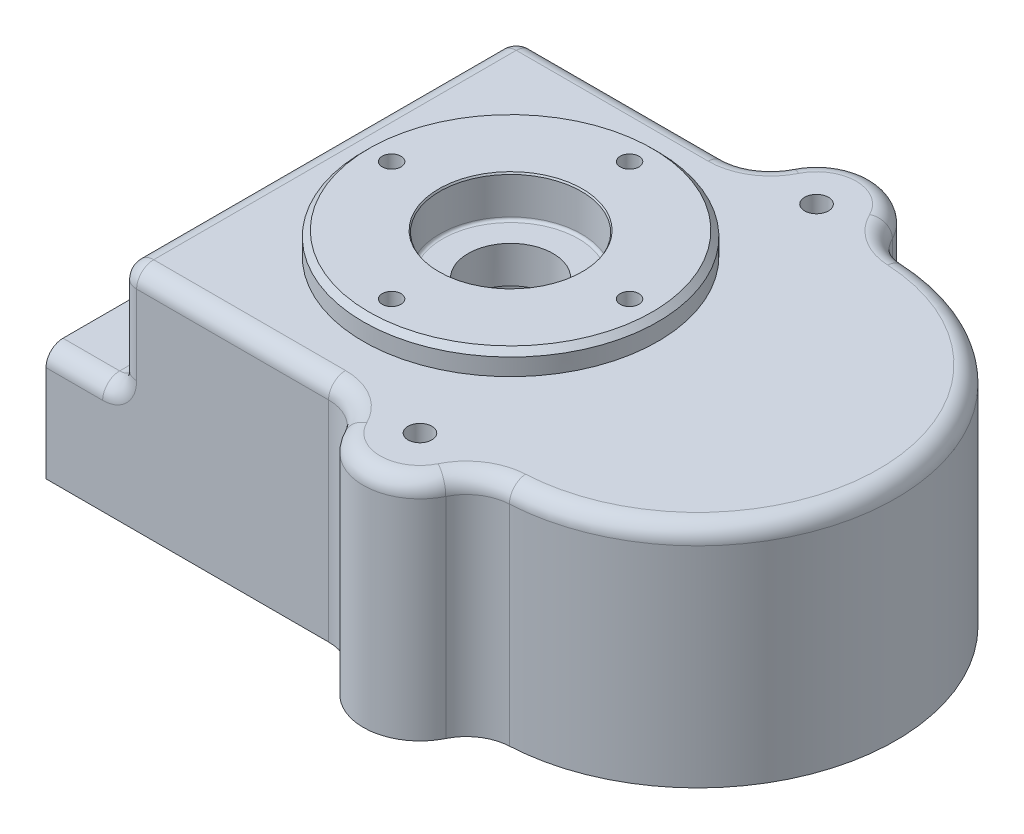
ISO-10303-21;
HEADER;
FILE_DESCRIPTION(('STEP AP214'),'2;1');
FILE_NAME('part.step','',(''),(''),'','','');
FILE_SCHEMA(('AUTOMOTIVE_DESIGN { 1 0 10303 214 1 1 1 1 }'));
ENDSEC;
DATA;
#1=APPLICATION_CONTEXT('core data for automotive mechanical design processes');
#2=APPLICATION_PROTOCOL_DEFINITION('international standard','automotive_design',2000,#1);
#3=PRODUCT_CONTEXT('',#1,'mechanical');
#4=PRODUCT('Part','Part','',(#3));
#5=PRODUCT_RELATED_PRODUCT_CATEGORY('part','',(#4));
#6=PRODUCT_DEFINITION_FORMATION('','',#4);
#7=PRODUCT_DEFINITION_CONTEXT('part definition',#1,'design');
#8=PRODUCT_DEFINITION('design','',#6,#7);
#9=PRODUCT_DEFINITION_SHAPE('','',#8);
#10=(LENGTH_UNIT() NAMED_UNIT(*) SI_UNIT(.MILLI.,.METRE.));
#11=(NAMED_UNIT(*) PLANE_ANGLE_UNIT() SI_UNIT($,.RADIAN.));
#12=(NAMED_UNIT(*) SI_UNIT($,.STERADIAN.) SOLID_ANGLE_UNIT());
#13=UNCERTAINTY_MEASURE_WITH_UNIT(LENGTH_MEASURE(1.E-05),#10,'distance_accuracy_value','');
#14=(GEOMETRIC_REPRESENTATION_CONTEXT(3) GLOBAL_UNCERTAINTY_ASSIGNED_CONTEXT((#13)) GLOBAL_UNIT_ASSIGNED_CONTEXT((#10,
#11,#12)) REPRESENTATION_CONTEXT('',''));
#15=CARTESIAN_POINT('',(0.,0.,0.));
#16=DIRECTION('',(0.,0.,1.));
#17=DIRECTION('',(1.,0.,0.));
#18=AXIS2_PLACEMENT_3D('',#15,#16,#17);
#19=CARTESIAN_POINT('',(67.,40.,0.));
#20=DIRECTION('',(0.,-1.,0.));
#21=DIRECTION('',(0.,0.,-1.));
#22=AXIS2_PLACEMENT_3D('',#19,#20,#21);
#23=PLANE('',#22);
#24=CARTESIAN_POINT('',(53.,40.,35.));
#25=DIRECTION('',(0.,1.,0.));
#26=DIRECTION('',(0.,0.,1.));
#27=AXIS2_PLACEMENT_3D('',#24,#25,#26);
#28=CIRCLE('',#27,2.09999999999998);
#29=CARTESIAN_POINT('',(53.,40.,37.1));
#30=VERTEX_POINT('',#29);
#31=EDGE_CURVE('E1198',#30,#30,#28,.T.);
#32=ORIENTED_EDGE('',*,*,#31,.F.);
#33=EDGE_LOOP('',(#32));
#34=FACE_BOUND('',#33,.T.);
#35=CARTESIAN_POINT('',(34.,40.,0.));
#36=DIRECTION('',(0.,-1.,0.));
#37=DIRECTION('',(0.,0.,-1.));
#38=AXIS2_PLACEMENT_3D('',#35,#36,#37);
#39=CIRCLE('',#38,26.);
#40=CARTESIAN_POINT('',(34.,40.,-26.));
#41=VERTEX_POINT('',#40);
#42=EDGE_CURVE('E687',#41,#41,#39,.F.);
#43=ORIENTED_EDGE('',*,*,#42,.F.);
#44=EDGE_LOOP('',(#43));
#45=FACE_BOUND('',#44,.T.);
#46=CARTESIAN_POINT('',(53.,40.,35.));
#47=DIRECTION('',(0.,-1.,0.));
#48=DIRECTION('',(0.,0.,-1.));
#49=AXIS2_PLACEMENT_3D('',#46,#47,#48);
#50=CIRCLE('',#49,7.);
#51=CARTESIAN_POINT('',(46.7293550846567,40.,38.1111111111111));
#52=VERTEX_POINT('',#51);
#53=CARTESIAN_POINT('',(59.2809893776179,40.,38.090173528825));
#54=VERTEX_POINT('',#53);
#55=EDGE_CURVE('E654',#52,#54,#50,.F.);
#56=ORIENTED_EDGE('',*,*,#55,.T.);
#57=CARTESIAN_POINT('',(69.1511155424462,40.,42.9461605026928));
#58=DIRECTION('',(0.,-1.,0.));
#59=DIRECTION('',(0.,0.,-1.));
#60=AXIS2_PLACEMENT_3D('',#57,#58,#59);
#61=CIRCLE('',#60,11.);
#62=CARTESIAN_POINT('',(68.6008301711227,40.,31.9599333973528));
#63=VERTEX_POINT('',#62);
#64=EDGE_CURVE('E657',#54,#63,#61,.T.);
#65=ORIENTED_EDGE('',*,*,#64,.T.);
#66=CARTESIAN_POINT('',(67.,40.,0.));
#67=DIRECTION('',(0.,-1.,0.));
#68=DIRECTION('',(0.,0.,-1.));
#69=AXIS2_PLACEMENT_3D('',#66,#67,#68);
#70=CIRCLE('',#69,32.);
#71=CARTESIAN_POINT('',(68.6008301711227,40.,-31.9599333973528));
#72=VERTEX_POINT('',#71);
#73=EDGE_CURVE('E630',#63,#72,#70,.F.);
#74=ORIENTED_EDGE('',*,*,#73,.T.);
#75=CARTESIAN_POINT('',(69.1511155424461,40.,-42.9461605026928));
#76=DIRECTION('',(0.,-1.,0.));
#77=DIRECTION('',(0.,0.,-1.));
#78=AXIS2_PLACEMENT_3D('',#75,#76,#77);
#79=CIRCLE('',#78,11.);
#80=CARTESIAN_POINT('',(59.2809893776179,40.,-38.090173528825));
#81=VERTEX_POINT('',#80);
#82=EDGE_CURVE('E633',#72,#81,#79,.T.);
#83=ORIENTED_EDGE('',*,*,#82,.T.);
#84=CARTESIAN_POINT('',(53.,40.,-35.));
#85=DIRECTION('',(0.,-1.,0.));
#86=DIRECTION('',(0.,0.,-1.));
#87=AXIS2_PLACEMENT_3D('',#84,#85,#86);
#88=CIRCLE('',#87,7.);
#89=CARTESIAN_POINT('',(46.7293550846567,40.,-38.1111111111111));
#90=VERTEX_POINT('',#89);
#91=EDGE_CURVE('E636',#81,#90,#88,.F.);
#92=ORIENTED_EDGE('',*,*,#91,.T.);
#93=CARTESIAN_POINT('',(36.8754845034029,40.,-43.));
#94=DIRECTION('',(0.,-1.,0.));
#95=DIRECTION('',(0.,0.,-1.));
#96=AXIS2_PLACEMENT_3D('',#93,#94,#95);
#97=CIRCLE('',#96,11.);
#98=CARTESIAN_POINT('',(36.8754845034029,40.,-32.));
#99=VERTEX_POINT('',#98);
#100=EDGE_CURVE('E639',#90,#99,#97,.T.);
#101=ORIENTED_EDGE('',*,*,#100,.T.);
#102=DIRECTION('',(-1.,0.,0.));
#103=VECTOR('',#102,1.);
#104=CARTESIAN_POINT('',(67.,40.,-32.));
#105=LINE('',#104,#103);
#106=CARTESIAN_POINT('',(3.,40.,-32.));
#107=VERTEX_POINT('',#106);
#108=EDGE_CURVE('E642',#99,#107,#105,.T.);
#109=ORIENTED_EDGE('',*,*,#108,.T.);
#110=DIRECTION('',(0.,0.,1.));
#111=VECTOR('',#110,1.);
#112=CARTESIAN_POINT('',(3.,40.,0.));
#113=LINE('',#112,#111);
#114=CARTESIAN_POINT('',(3.00000000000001,40.,32.));
#115=VERTEX_POINT('',#114);
#116=EDGE_CURVE('E645',#107,#115,#113,.T.);
#117=ORIENTED_EDGE('',*,*,#116,.T.);
#118=DIRECTION('',(1.,0.,0.));
#119=VECTOR('',#118,1.);
#120=CARTESIAN_POINT('',(67.,40.,32.));
#121=LINE('',#120,#119);
#122=CARTESIAN_POINT('',(36.8754845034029,40.,32.));
#123=VERTEX_POINT('',#122);
#124=EDGE_CURVE('E648',#115,#123,#121,.T.);
#125=ORIENTED_EDGE('',*,*,#124,.T.);
#126=CARTESIAN_POINT('',(36.8754845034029,40.,43.));
#127=DIRECTION('',(0.,-1.,0.));
#128=DIRECTION('',(0.,0.,-1.));
#129=AXIS2_PLACEMENT_3D('',#126,#127,#128);
#130=CIRCLE('',#129,11.);
#131=EDGE_CURVE('E651',#123,#52,#130,.T.);
#132=ORIENTED_EDGE('',*,*,#131,.T.);
#133=EDGE_LOOP('',(#56,#65,#74,#83,#92,#101,#109,#117,#125,#132));
#134=FACE_BOUND('',#133,.T.);
#135=CARTESIAN_POINT('',(53.,40.,-35.));
#136=DIRECTION('',(0.,1.,0.));
#137=DIRECTION('',(0.,0.,1.));
#138=AXIS2_PLACEMENT_3D('',#135,#136,#137);
#139=CIRCLE('',#138,2.09999999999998);
#140=CARTESIAN_POINT('',(53.,40.,-32.9));
#141=VERTEX_POINT('',#140);
#142=EDGE_CURVE('E1193',#141,#141,#139,.T.);
#143=ORIENTED_EDGE('',*,*,#142,.F.);
#144=EDGE_LOOP('',(#143));
#145=FACE_BOUND('',#144,.T.);
#146=ADVANCED_FACE('F64',(#34,#45,#134,#145),#23,.F.);
#147=CARTESIAN_POINT('',(67.,0.,0.));
#148=DIRECTION('',(0.,-1.,0.));
#149=DIRECTION('',(0.,0.,-1.));
#150=AXIS2_PLACEMENT_3D('',#147,#148,#149);
#151=PLANE('',#150);
#152=CARTESIAN_POINT('',(53.,0.,-35.));
#153=DIRECTION('',(0.,1.,0.));
#154=DIRECTION('',(0.,0.,1.));
#155=AXIS2_PLACEMENT_3D('',#152,#153,#154);
#156=CIRCLE('',#155,2.09999999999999);
#157=CARTESIAN_POINT('',(53.,0.,-32.9));
#158=VERTEX_POINT('',#157);
#159=EDGE_CURVE('E1195',#158,#158,#156,.T.);
#160=ORIENTED_EDGE('',*,*,#159,.T.);
#161=EDGE_LOOP('',(#160));
#162=FACE_BOUND('',#161,.T.);
#163=DIRECTION('',(-1.,0.,0.));
#164=VECTOR('',#163,1.);
#165=CARTESIAN_POINT('',(0.,0.,-35.));
#166=LINE('',#165,#164);
#167=CARTESIAN_POINT('',(36.8754845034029,0.,-35.));
#168=VERTEX_POINT('',#167);
#169=CARTESIAN_POINT('',(-13.,0.,-35.));
#170=VERTEX_POINT('',#169);
#171=EDGE_CURVE('E483',#168,#170,#166,.T.);
#172=ORIENTED_EDGE('',*,*,#171,.F.);
#173=CARTESIAN_POINT('',(36.8754845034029,0.,-43.));
#174=DIRECTION('',(0.,-1.,0.));
#175=DIRECTION('',(0.,0.,-1.));
#176=AXIS2_PLACEMENT_3D('',#173,#174,#175);
#177=CIRCLE('',#176,8.);
#178=CARTESIAN_POINT('',(44.0419358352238,0.,-39.4444444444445));
#179=VERTEX_POINT('',#178);
#180=EDGE_CURVE('E543',#168,#179,#177,.F.);
#181=ORIENTED_EDGE('',*,*,#180,.T.);
#182=CARTESIAN_POINT('',(53.,0.,-35.));
#183=DIRECTION('',(0.,-1.,0.));
#184=DIRECTION('',(0.,0.,-1.));
#185=AXIS2_PLACEMENT_3D('',#182,#183,#184);
#186=CIRCLE('',#185,10.);
#187=CARTESIAN_POINT('',(61.9728419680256,0.,-39.4145336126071));
#188=VERTEX_POINT('',#187);
#189=EDGE_CURVE('E418',#179,#188,#186,.T.);
#190=ORIENTED_EDGE('',*,*,#189,.T.);
#191=CARTESIAN_POINT('',(69.1511155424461,0.,-42.9461605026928));
#192=DIRECTION('',(0.,-1.,0.));
#193=DIRECTION('',(0.,0.,-1.));
#194=AXIS2_PLACEMENT_3D('',#191,#192,#193);
#195=CIRCLE('',#194,8.);
#196=CARTESIAN_POINT('',(68.7509079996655,0.,-34.9561771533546));
#197=VERTEX_POINT('',#196);
#198=EDGE_CURVE('E540',#188,#197,#195,.F.);
#199=ORIENTED_EDGE('',*,*,#198,.T.);
#200=CARTESIAN_POINT('',(67.,0.,0.));
#201=DIRECTION('',(0.,1.,0.));
#202=DIRECTION('',(0.,0.,-1.));
#203=AXIS2_PLACEMENT_3D('',#200,#201,#202);
#204=CIRCLE('',#203,35.);
#205=CARTESIAN_POINT('',(68.7509079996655,0.,34.9561771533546));
#206=VERTEX_POINT('',#205);
#207=EDGE_CURVE('E479',#206,#197,#204,.T.);
#208=ORIENTED_EDGE('',*,*,#207,.F.);
#209=CARTESIAN_POINT('',(69.1511155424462,0.,42.9461605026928));
#210=DIRECTION('',(0.,-1.,0.));
#211=DIRECTION('',(0.,0.,-1.));
#212=AXIS2_PLACEMENT_3D('',#209,#210,#211);
#213=CIRCLE('',#212,8.);
#214=CARTESIAN_POINT('',(61.9728419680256,0.,39.4145336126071));
#215=VERTEX_POINT('',#214);
#216=EDGE_CURVE('E534',#206,#215,#213,.F.);
#217=ORIENTED_EDGE('',*,*,#216,.T.);
#218=CARTESIAN_POINT('',(53.,0.,35.));
#219=DIRECTION('',(0.,1.,0.));
#220=DIRECTION('',(0.,0.,1.));
#221=AXIS2_PLACEMENT_3D('',#218,#219,#220);
#222=CIRCLE('',#221,10.);
#223=CARTESIAN_POINT('',(44.0419358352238,0.,39.4444444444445));
#224=VERTEX_POINT('',#223);
#225=EDGE_CURVE('E448',#224,#215,#222,.T.);
#226=ORIENTED_EDGE('',*,*,#225,.F.);
#227=CARTESIAN_POINT('',(36.8754845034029,0.,43.));
#228=DIRECTION('',(0.,-1.,0.));
#229=DIRECTION('',(0.,0.,-1.));
#230=AXIS2_PLACEMENT_3D('',#227,#228,#229);
#231=CIRCLE('',#230,8.);
#232=CARTESIAN_POINT('',(36.8754845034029,0.,35.));
#233=VERTEX_POINT('',#232);
#234=EDGE_CURVE('E537',#224,#233,#231,.F.);
#235=ORIENTED_EDGE('',*,*,#234,.T.);
#236=DIRECTION('',(1.,0.,0.));
#237=VECTOR('',#236,1.);
#238=CARTESIAN_POINT('',(0.,0.,35.));
#239=LINE('',#238,#237);
#240=CARTESIAN_POINT('',(-13.,0.,35.));
#241=VERTEX_POINT('',#240);
#242=EDGE_CURVE('E475',#241,#233,#239,.T.);
#243=ORIENTED_EDGE('',*,*,#242,.F.);
#244=DIRECTION('',(0.,0.,-1.));
#245=VECTOR('',#244,1.);
#246=CARTESIAN_POINT('',(-13.,0.,35.));
#247=LINE('',#246,#245);
#248=CARTESIAN_POINT('',(-13.,0.,15.));
#249=VERTEX_POINT('',#248);
#250=EDGE_CURVE('E455',#241,#249,#247,.T.);
#251=ORIENTED_EDGE('',*,*,#250,.T.);
#252=DIRECTION('',(1.,0.,0.));
#253=VECTOR('',#252,1.);
#254=CARTESIAN_POINT('',(-13.,0.,15.));
#255=LINE('',#254,#253);
#256=CARTESIAN_POINT('',(-3.00000000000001,0.,15.));
#257=VERTEX_POINT('',#256);
#258=EDGE_CURVE('E467',#249,#257,#255,.T.);
#259=ORIENTED_EDGE('',*,*,#258,.T.);
#260=CARTESIAN_POINT('',(-3.,0.,12.));
#261=DIRECTION('',(0.,-1.,0.));
#262=DIRECTION('',(0.,0.,-1.));
#263=AXIS2_PLACEMENT_3D('',#260,#261,#262);
#264=CIRCLE('',#263,3.);
#265=CARTESIAN_POINT('',(0.,0.,12.));
#266=VERTEX_POINT('',#265);
#267=EDGE_CURVE('E684',#257,#266,#264,.F.);
#268=ORIENTED_EDGE('',*,*,#267,.T.);
#269=DIRECTION('',(0.,0.,1.));
#270=VECTOR('',#269,1.);
#271=CARTESIAN_POINT('',(0.,0.,35.));
#272=LINE('',#271,#270);
#273=CARTESIAN_POINT('',(0.,0.,-12.));
#274=VERTEX_POINT('',#273);
#275=EDGE_CURVE('E471',#274,#266,#272,.T.);
#276=ORIENTED_EDGE('',*,*,#275,.F.);
#277=CARTESIAN_POINT('',(-3.00000000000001,0.,-12.));
#278=DIRECTION('',(0.,-1.,0.));
#279=DIRECTION('',(0.,0.,-1.));
#280=AXIS2_PLACEMENT_3D('',#277,#278,#279);
#281=CIRCLE('',#280,3.);
#282=CARTESIAN_POINT('',(-3.00000000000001,0.,-15.));
#283=VERTEX_POINT('',#282);
#284=EDGE_CURVE('E681',#274,#283,#281,.F.);
#285=ORIENTED_EDGE('',*,*,#284,.T.);
#286=DIRECTION('',(1.,0.,0.));
#287=VECTOR('',#286,1.);
#288=CARTESIAN_POINT('',(-13.,0.,-15.));
#289=LINE('',#288,#287);
#290=CARTESIAN_POINT('',(-13.,0.,-15.));
#291=VERTEX_POINT('',#290);
#292=EDGE_CURVE('E436',#291,#283,#289,.T.);
#293=ORIENTED_EDGE('',*,*,#292,.F.);
#294=DIRECTION('',(0.,0.,1.));
#295=VECTOR('',#294,1.);
#296=CARTESIAN_POINT('',(-13.,0.,-35.));
#297=LINE('',#296,#295);
#298=EDGE_CURVE('E433',#170,#291,#297,.T.);
#299=ORIENTED_EDGE('',*,*,#298,.F.);
#300=EDGE_LOOP('',(#172,#181,#190,#199,#208,#217,#226,#235,#243,#251,#259,#268,#276,#285,#293,#299));
#301=FACE_BOUND('',#300,.T.);
#302=CARTESIAN_POINT('',(34.,0.,0.));
#303=DIRECTION('',(0.,-1.,0.));
#304=DIRECTION('',(0.,0.,-1.));
#305=AXIS2_PLACEMENT_3D('',#302,#303,#304);
#306=CIRCLE('',#305,18.);
#307=CARTESIAN_POINT('',(43.9498743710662,0.,15.));
#308=VERTEX_POINT('',#307);
#309=CARTESIAN_POINT('',(43.9498743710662,0.,-15.));
#310=VERTEX_POINT('',#309);
#311=EDGE_CURVE('E80',#308,#310,#306,.T.);
#312=ORIENTED_EDGE('',*,*,#311,.F.);
#313=DIRECTION('',(-1.,0.,0.));
#314=VECTOR('',#313,1.);
#315=CARTESIAN_POINT('',(43.9498743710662,0.,15.));
#316=LINE('',#315,#314);
#317=CARTESIAN_POINT('',(57.0501256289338,0.,15.));
#318=VERTEX_POINT('',#317);
#319=EDGE_CURVE('E371',#318,#308,#316,.T.);
#320=ORIENTED_EDGE('',*,*,#319,.F.);
#321=CARTESIAN_POINT('',(67.,0.,0.));
#322=DIRECTION('',(0.,-1.,0.));
#323=DIRECTION('',(0.,0.,-1.));
#324=AXIS2_PLACEMENT_3D('',#321,#322,#323);
#325=CIRCLE('',#324,18.);
#326=CARTESIAN_POINT('',(57.0501256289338,0.,-15.));
#327=VERTEX_POINT('',#326);
#328=EDGE_CURVE('E390',#327,#318,#325,.T.);
#329=ORIENTED_EDGE('',*,*,#328,.F.);
#330=DIRECTION('',(1.,0.,0.));
#331=VECTOR('',#330,1.);
#332=CARTESIAN_POINT('',(43.9498743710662,0.,-15.));
#333=LINE('',#332,#331);
#334=EDGE_CURVE('E386',#310,#327,#333,.T.);
#335=ORIENTED_EDGE('',*,*,#334,.F.);
#336=EDGE_LOOP('',(#312,#320,#329,#335));
#337=FACE_BOUND('',#336,.T.);
#338=CARTESIAN_POINT('',(53.,0.,35.));
#339=DIRECTION('',(0.,1.,0.));
#340=DIRECTION('',(0.,0.,1.));
#341=AXIS2_PLACEMENT_3D('',#338,#339,#340);
#342=CIRCLE('',#341,2.09999999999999);
#343=CARTESIAN_POINT('',(53.,0.,37.1));
#344=VERTEX_POINT('',#343);
#345=EDGE_CURVE('E334',#344,#344,#342,.T.);
#346=ORIENTED_EDGE('',*,*,#345,.T.);
#347=EDGE_LOOP('',(#346));
#348=FACE_BOUND('',#347,.T.);
#349=ADVANCED_FACE('F845',(#162,#301,#337,#348),#151,.T.);
#350=CARTESIAN_POINT('',(34.,0.,0.));
#351=DIRECTION('',(0.,1.,0.));
#352=DIRECTION('',(0.,0.,1.));
#353=AXIS2_PLACEMENT_3D('',#350,#351,#352);
#354=CYLINDRICAL_SURFACE('',#353,7.5);
#355=CARTESIAN_POINT('',(34.,30.2017212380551,0.));
#356=DIRECTION('',(0.,-1.,0.));
#357=DIRECTION('',(0.,0.,-1.));
#358=AXIS2_PLACEMENT_3D('',#355,#356,#357);
#359=CIRCLE('',#358,7.5);
#360=CARTESIAN_POINT('',(34.,30.2017212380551,-7.5));
#361=VERTEX_POINT('',#360);
#362=EDGE_CURVE('E365',#361,#361,#359,.T.);
#363=ORIENTED_EDGE('',*,*,#362,.T.);
#364=EDGE_LOOP('',(#363));
#365=FACE_BOUND('',#364,.T.);
#366=CARTESIAN_POINT('',(34.,36.7,0.));
#367=DIRECTION('',(0.,1.,0.));
#368=DIRECTION('',(0.,0.,1.));
#369=AXIS2_PLACEMENT_3D('',#366,#367,#368);
#370=CIRCLE('',#369,7.5);
#371=CARTESIAN_POINT('',(34.,36.7,7.5));
#372=VERTEX_POINT('',#371);
#373=EDGE_CURVE('E400',#372,#372,#370,.F.);
#374=ORIENTED_EDGE('',*,*,#373,.F.);
#375=EDGE_LOOP('',(#374));
#376=FACE_BOUND('',#375,.T.);
#377=ADVANCED_FACE('F851',(#365,#376),#354,.F.);
#378=CARTESIAN_POINT('',(0.,40.,-35.));
#379=DIRECTION('',(0.,0.,1.));
#380=DIRECTION('',(1.,0.,0.));
#381=AXIS2_PLACEMENT_3D('',#378,#379,#380);
#382=PLANE('',#381);
#383=DIRECTION('',(0.,-1.,0.));
#384=VECTOR('',#383,1.);
#385=CARTESIAN_POINT('',(-13.,0.,-35.));
#386=LINE('',#385,#384);
#387=CARTESIAN_POINT('',(-13.,17.,-35.));
#388=VERTEX_POINT('',#387);
#389=EDGE_CURVE('E422',#388,#170,#386,.T.);
#390=ORIENTED_EDGE('',*,*,#389,.F.);
#391=DIRECTION('',(1.,0.,0.));
#392=VECTOR('',#391,1.);
#393=CARTESIAN_POINT('',(0.,17.,-35.));
#394=LINE('',#393,#392);
#395=CARTESIAN_POINT('',(-3.00000000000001,17.,-35.));
#396=VERTEX_POINT('',#395);
#397=EDGE_CURVE('E556',#388,#396,#394,.T.);
#398=ORIENTED_EDGE('',*,*,#397,.T.);
#399=CARTESIAN_POINT('',(-3.00000000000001,23.,-35.));
#400=DIRECTION('',(0.,0.,1.));
#401=DIRECTION('',(1.,0.,0.));
#402=AXIS2_PLACEMENT_3D('',#399,#400,#401);
#403=CIRCLE('',#402,6.);
#404=CARTESIAN_POINT('',(2.99999999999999,23.,-35.));
#405=VERTEX_POINT('',#404);
#406=EDGE_CURVE('E552',#405,#396,#403,.F.);
#407=ORIENTED_EDGE('',*,*,#406,.F.);
#408=DIRECTION('',(0.,-1.,0.));
#409=VECTOR('',#408,1.);
#410=CARTESIAN_POINT('',(2.99999999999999,40.,-35.));
#411=LINE('',#410,#409);
#412=CARTESIAN_POINT('',(2.99999999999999,37.,-35.));
#413=VERTEX_POINT('',#412);
#414=EDGE_CURVE('E546',#405,#413,#411,.F.);
#415=ORIENTED_EDGE('',*,*,#414,.T.);
#416=DIRECTION('',(-1.,0.,0.));
#417=VECTOR('',#416,1.);
#418=CARTESIAN_POINT('',(0.,37.,-35.));
#419=LINE('',#418,#417);
#420=CARTESIAN_POINT('',(36.8754845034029,37.,-35.));
#421=VERTEX_POINT('',#420);
#422=EDGE_CURVE('E549',#413,#421,#419,.F.);
#423=ORIENTED_EDGE('',*,*,#422,.T.);
#424=DIRECTION('',(0.,-1.,0.));
#425=VECTOR('',#424,1.);
#426=CARTESIAN_POINT('',(36.8754845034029,40.,-35.));
#427=LINE('',#426,#425);
#428=EDGE_CURVE('E531',#421,#168,#427,.T.);
#429=ORIENTED_EDGE('',*,*,#428,.T.);
#430=ORIENTED_EDGE('',*,*,#171,.T.);
#431=EDGE_LOOP('',(#390,#398,#407,#415,#423,#429,#430));
#432=FACE_BOUND('',#431,.T.);
#433=ADVANCED_FACE('F860',(#432),#382,.F.);
#434=CARTESIAN_POINT('',(0.,40.,35.));
#435=DIRECTION('',(1.,0.,0.));
#436=DIRECTION('',(0.,0.,-1.));
#437=AXIS2_PLACEMENT_3D('',#434,#435,#436);
#438=PLANE('',#437);
#439=ORIENTED_EDGE('',*,*,#275,.T.);
#440=DIRECTION('',(0.,1.,0.));
#441=VECTOR('',#440,1.);
#442=CARTESIAN_POINT('',(0.,40.,12.));
#443=LINE('',#442,#441);
#444=CARTESIAN_POINT('',(0.,17.,12.));
#445=VERTEX_POINT('',#444);
#446=EDGE_CURVE('E618',#266,#445,#443,.T.);
#447=ORIENTED_EDGE('',*,*,#446,.T.);
#448=CARTESIAN_POINT('',(0.,17.,18.));
#449=DIRECTION('',(1.,0.,0.));
#450=DIRECTION('',(0.,0.,-1.));
#451=AXIS2_PLACEMENT_3D('',#448,#449,#450);
#452=CIRCLE('',#451,6.);
#453=CARTESIAN_POINT('',(0.,23.,18.));
#454=VERTEX_POINT('',#453);
#455=EDGE_CURVE('E615',#445,#454,#452,.T.);
#456=ORIENTED_EDGE('',*,*,#455,.T.);
#457=DIRECTION('',(0.,0.,1.));
#458=VECTOR('',#457,1.);
#459=CARTESIAN_POINT('',(0.,23.,35.));
#460=LINE('',#459,#458);
#461=CARTESIAN_POINT('',(0.,23.,32.));
#462=VERTEX_POINT('',#461);
#463=EDGE_CURVE('E612',#454,#462,#460,.T.);
#464=ORIENTED_EDGE('',*,*,#463,.T.);
#465=DIRECTION('',(0.,-1.,0.));
#466=VECTOR('',#465,1.);
#467=CARTESIAN_POINT('',(0.,40.,32.));
#468=LINE('',#467,#466);
#469=CARTESIAN_POINT('',(0.,37.,32.));
#470=VERTEX_POINT('',#469);
#471=EDGE_CURVE('E609',#462,#470,#468,.F.);
#472=ORIENTED_EDGE('',*,*,#471,.T.);
#473=DIRECTION('',(0.,0.,1.));
#474=VECTOR('',#473,1.);
#475=CARTESIAN_POINT('',(0.,37.,35.));
#476=LINE('',#475,#474);
#477=CARTESIAN_POINT('',(0.,37.,-32.));
#478=VERTEX_POINT('',#477);
#479=EDGE_CURVE('E600',#470,#478,#476,.F.);
#480=ORIENTED_EDGE('',*,*,#479,.T.);
#481=DIRECTION('',(0.,-1.,0.));
#482=VECTOR('',#481,1.);
#483=CARTESIAN_POINT('',(0.,40.,-32.));
#484=LINE('',#483,#482);
#485=CARTESIAN_POINT('',(0.,23.,-32.));
#486=VERTEX_POINT('',#485);
#487=EDGE_CURVE('E594',#478,#486,#484,.T.);
#488=ORIENTED_EDGE('',*,*,#487,.T.);
#489=DIRECTION('',(0.,0.,-1.));
#490=VECTOR('',#489,1.);
#491=CARTESIAN_POINT('',(0.,23.,-18.));
#492=LINE('',#491,#490);
#493=CARTESIAN_POINT('',(0.,23.,-18.));
#494=VERTEX_POINT('',#493);
#495=EDGE_CURVE('E597',#486,#494,#492,.F.);
#496=ORIENTED_EDGE('',*,*,#495,.T.);
#497=CARTESIAN_POINT('',(0.,17.,-18.));
#498=DIRECTION('',(1.,0.,0.));
#499=DIRECTION('',(0.,0.,-1.));
#500=AXIS2_PLACEMENT_3D('',#497,#498,#499);
#501=CIRCLE('',#500,6.);
#502=CARTESIAN_POINT('',(0.,17.,-12.));
#503=VERTEX_POINT('',#502);
#504=EDGE_CURVE('E603',#494,#503,#501,.T.);
#505=ORIENTED_EDGE('',*,*,#504,.T.);
#506=DIRECTION('',(0.,1.,0.));
#507=VECTOR('',#506,1.);
#508=CARTESIAN_POINT('',(0.,0.,-12.));
#509=LINE('',#508,#507);
#510=EDGE_CURVE('E606',#503,#274,#509,.F.);
#511=ORIENTED_EDGE('',*,*,#510,.T.);
#512=EDGE_LOOP('',(#439,#447,#456,#464,#472,#480,#488,#496,#505,#511));
#513=FACE_BOUND('',#512,.T.);
#514=ADVANCED_FACE('F863',(#513),#438,.F.);
#515=CARTESIAN_POINT('',(0.,40.,35.));
#516=DIRECTION('',(0.,0.,-1.));
#517=DIRECTION('',(-1.,0.,0.));
#518=AXIS2_PLACEMENT_3D('',#515,#516,#517);
#519=PLANE('',#518);
#520=CARTESIAN_POINT('',(-3.,23.,35.));
#521=DIRECTION('',(0.,0.,-1.));
#522=DIRECTION('',(-1.,0.,0.));
#523=AXIS2_PLACEMENT_3D('',#520,#521,#522);
#524=CIRCLE('',#523,6.);
#525=CARTESIAN_POINT('',(-3.,17.,35.));
#526=VERTEX_POINT('',#525);
#527=CARTESIAN_POINT('',(3.,23.,35.));
#528=VERTEX_POINT('',#527);
#529=EDGE_CURVE('E575',#526,#528,#524,.F.);
#530=ORIENTED_EDGE('',*,*,#529,.F.);
#531=DIRECTION('',(1.,0.,0.));
#532=VECTOR('',#531,1.);
#533=CARTESIAN_POINT('',(-13.,17.,35.));
#534=LINE('',#533,#532);
#535=CARTESIAN_POINT('',(-13.,17.,35.));
#536=VERTEX_POINT('',#535);
#537=EDGE_CURVE('E585',#526,#536,#534,.F.);
#538=ORIENTED_EDGE('',*,*,#537,.T.);
#539=DIRECTION('',(0.,-1.,0.));
#540=VECTOR('',#539,1.);
#541=CARTESIAN_POINT('',(-13.,0.,35.));
#542=LINE('',#541,#540);
#543=EDGE_CURVE('E452',#536,#241,#542,.T.);
#544=ORIENTED_EDGE('',*,*,#543,.T.);
#545=ORIENTED_EDGE('',*,*,#242,.T.);
#546=DIRECTION('',(0.,1.,0.));
#547=VECTOR('',#546,1.);
#548=CARTESIAN_POINT('',(36.8754845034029,40.,35.));
#549=LINE('',#548,#547);
#550=CARTESIAN_POINT('',(36.8754845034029,37.,35.));
#551=VERTEX_POINT('',#550);
#552=EDGE_CURVE('E520',#233,#551,#549,.T.);
#553=ORIENTED_EDGE('',*,*,#552,.T.);
#554=DIRECTION('',(1.,0.,0.));
#555=VECTOR('',#554,1.);
#556=CARTESIAN_POINT('',(0.,37.,35.));
#557=LINE('',#556,#555);
#558=CARTESIAN_POINT('',(3.,37.,35.));
#559=VERTEX_POINT('',#558);
#560=EDGE_CURVE('E582',#551,#559,#557,.F.);
#561=ORIENTED_EDGE('',*,*,#560,.T.);
#562=DIRECTION('',(0.,-1.,0.));
#563=VECTOR('',#562,1.);
#564=CARTESIAN_POINT('',(3.,40.,35.));
#565=LINE('',#564,#563);
#566=EDGE_CURVE('E579',#559,#528,#565,.T.);
#567=ORIENTED_EDGE('',*,*,#566,.T.);
#568=EDGE_LOOP('',(#530,#538,#544,#545,#553,#561,#567));
#569=FACE_BOUND('',#568,.T.);
#570=ADVANCED_FACE('F869',(#569),#519,.F.);
#571=CARTESIAN_POINT('',(67.,40.,0.));
#572=DIRECTION('',(0.,-1.,0.));
#573=DIRECTION('',(0.,0.,-1.));
#574=AXIS2_PLACEMENT_3D('',#571,#572,#573);
#575=CYLINDRICAL_SURFACE('',#574,35.);
#576=DIRECTION('',(0.,-1.,0.));
#577=VECTOR('',#576,1.);
#578=CARTESIAN_POINT('',(68.7509079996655,40.,-34.9561771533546));
#579=LINE('',#578,#577);
#580=CARTESIAN_POINT('',(68.7509079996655,37.,-34.9561771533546));
#581=VERTEX_POINT('',#580);
#582=EDGE_CURVE('E514',#197,#581,#579,.F.);
#583=ORIENTED_EDGE('',*,*,#582,.T.);
#584=CARTESIAN_POINT('',(67.,37.,0.));
#585=DIRECTION('',(0.,-1.,0.));
#586=DIRECTION('',(0.,0.,-1.));
#587=AXIS2_PLACEMENT_3D('',#584,#585,#586);
#588=CIRCLE('',#587,35.);
#589=CARTESIAN_POINT('',(68.7509079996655,37.,34.9561771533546));
#590=VERTEX_POINT('',#589);
#591=EDGE_CURVE('E678',#581,#590,#588,.T.);
#592=ORIENTED_EDGE('',*,*,#591,.T.);
#593=DIRECTION('',(0.,-1.,0.));
#594=VECTOR('',#593,1.);
#595=CARTESIAN_POINT('',(68.7509079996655,40.,34.9561771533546));
#596=LINE('',#595,#594);
#597=EDGE_CURVE('E517',#590,#206,#596,.T.);
#598=ORIENTED_EDGE('',*,*,#597,.T.);
#599=ORIENTED_EDGE('',*,*,#207,.T.);
#600=EDGE_LOOP('',(#583,#592,#598,#599));
#601=FACE_BOUND('',#600,.T.);
#602=ADVANCED_FACE('F865',(#601),#575,.T.);
#603=CARTESIAN_POINT('',(-13.,20.,35.));
#604=DIRECTION('',(0.,1.,0.));
#605=DIRECTION('',(0.,0.,1.));
#606=AXIS2_PLACEMENT_3D('',#603,#604,#605);
#607=PLANE('',#606);
#608=DIRECTION('',(0.,0.,1.));
#609=VECTOR('',#608,1.);
#610=CARTESIAN_POINT('',(-13.,20.,35.));
#611=LINE('',#610,#609);
#612=CARTESIAN_POINT('',(-13.,20.,18.));
#613=VERTEX_POINT('',#612);
#614=CARTESIAN_POINT('',(-13.,20.,32.));
#615=VERTEX_POINT('',#614);
#616=EDGE_CURVE('E463',#613,#615,#611,.T.);
#617=ORIENTED_EDGE('',*,*,#616,.T.);
#618=DIRECTION('',(1.,0.,0.));
#619=VECTOR('',#618,1.);
#620=CARTESIAN_POINT('',(0.,20.,32.));
#621=LINE('',#620,#619);
#622=CARTESIAN_POINT('',(-3.,20.,32.));
#623=VERTEX_POINT('',#622);
#624=EDGE_CURVE('E572',#615,#623,#621,.T.);
#625=ORIENTED_EDGE('',*,*,#624,.T.);
#626=DIRECTION('',(0.,0.,1.));
#627=VECTOR('',#626,1.);
#628=CARTESIAN_POINT('',(-3.,20.,35.));
#629=LINE('',#628,#627);
#630=CARTESIAN_POINT('',(-3.,20.,18.));
#631=VERTEX_POINT('',#630);
#632=EDGE_CURVE('E569',#623,#631,#629,.F.);
#633=ORIENTED_EDGE('',*,*,#632,.T.);
#634=DIRECTION('',(1.,0.,0.));
#635=VECTOR('',#634,1.);
#636=CARTESIAN_POINT('',(-13.,20.,18.));
#637=LINE('',#636,#635);
#638=EDGE_CURVE('E491',#631,#613,#637,.F.);
#639=ORIENTED_EDGE('',*,*,#638,.T.);
#640=EDGE_LOOP('',(#617,#625,#633,#639));
#641=FACE_BOUND('',#640,.T.);
#642=ADVANCED_FACE('F868',(#641),#607,.T.);
#643=CARTESIAN_POINT('',(-13.,0.,15.));
#644=DIRECTION('',(0.,0.,-1.));
#645=DIRECTION('',(-1.,0.,0.));
#646=AXIS2_PLACEMENT_3D('',#643,#644,#645);
#647=PLANE('',#646);
#648=DIRECTION('',(1.,0.,0.));
#649=VECTOR('',#648,1.);
#650=CARTESIAN_POINT('',(-13.,17.,15.));
#651=LINE('',#650,#649);
#652=CARTESIAN_POINT('',(-13.,17.,15.));
#653=VERTEX_POINT('',#652);
#654=CARTESIAN_POINT('',(-3.,17.,15.));
#655=VERTEX_POINT('',#654);
#656=EDGE_CURVE('E487',#653,#655,#651,.T.);
#657=ORIENTED_EDGE('',*,*,#656,.T.);
#658=DIRECTION('',(0.,1.,0.));
#659=VECTOR('',#658,1.);
#660=CARTESIAN_POINT('',(-3.,0.,15.));
#661=LINE('',#660,#659);
#662=EDGE_CURVE('E624',#655,#257,#661,.F.);
#663=ORIENTED_EDGE('',*,*,#662,.T.);
#664=ORIENTED_EDGE('',*,*,#258,.F.);
#665=DIRECTION('',(0.,1.,0.));
#666=VECTOR('',#665,1.);
#667=CARTESIAN_POINT('',(-13.,0.,15.));
#668=LINE('',#667,#666);
#669=EDGE_CURVE('E459',#249,#653,#668,.T.);
#670=ORIENTED_EDGE('',*,*,#669,.T.);
#671=EDGE_LOOP('',(#657,#663,#664,#670));
#672=FACE_BOUND('',#671,.T.);
#673=ADVANCED_FACE('F857',(#672),#647,.T.);
#674=CARTESIAN_POINT('',(-13.,0.,0.));
#675=DIRECTION('',(-1.,0.,0.));
#676=DIRECTION('',(0.,0.,1.));
#677=AXIS2_PLACEMENT_3D('',#674,#675,#676);
#678=PLANE('',#677);
#679=CARTESIAN_POINT('',(-13.,10.,25.));
#680=DIRECTION('',(-1.,0.,0.));
#681=DIRECTION('',(0.,0.,1.));
#682=AXIS2_PLACEMENT_3D('',#679,#680,#681);
#683=CIRCLE('',#682,2.09999999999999);
#684=CARTESIAN_POINT('',(-13.,10.,27.1));
#685=VERTEX_POINT('',#684);
#686=EDGE_CURVE('E440',#685,#685,#683,.T.);
#687=ORIENTED_EDGE('',*,*,#686,.F.);
#688=EDGE_LOOP('',(#687));
#689=FACE_BOUND('',#688,.T.);
#690=ORIENTED_EDGE('',*,*,#543,.F.);
#691=CARTESIAN_POINT('',(-13.,17.,32.));
#692=DIRECTION('',(-1.,0.,0.));
#693=DIRECTION('',(0.,0.,1.));
#694=AXIS2_PLACEMENT_3D('',#691,#692,#693);
#695=CIRCLE('',#694,3.);
#696=EDGE_CURVE('E588',#536,#615,#695,.T.);
#697=ORIENTED_EDGE('',*,*,#696,.T.);
#698=ORIENTED_EDGE('',*,*,#616,.F.);
#699=CARTESIAN_POINT('',(-13.,17.,18.));
#700=DIRECTION('',(-1.,0.,0.));
#701=DIRECTION('',(0.,0.,1.));
#702=AXIS2_PLACEMENT_3D('',#699,#700,#701);
#703=CIRCLE('',#702,3.);
#704=EDGE_CURVE('E494',#613,#653,#703,.T.);
#705=ORIENTED_EDGE('',*,*,#704,.T.);
#706=ORIENTED_EDGE('',*,*,#669,.F.);
#707=ORIENTED_EDGE('',*,*,#250,.F.);
#708=EDGE_LOOP('',(#690,#697,#698,#705,#706,#707));
#709=FACE_BOUND('',#708,.T.);
#710=ADVANCED_FACE('F1078',(#689,#709),#678,.T.);
#711=CARTESIAN_POINT('',(53.,68.2842712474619,35.));
#712=DIRECTION('',(0.,-1.,0.));
#713=DIRECTION('',(0.,0.,-1.));
#714=AXIS2_PLACEMENT_3D('',#711,#712,#713);
#715=CYLINDRICAL_SURFACE('',#714,10.);
#716=DIRECTION('',(0.,-1.,0.));
#717=VECTOR('',#716,1.);
#718=CARTESIAN_POINT('',(61.9728419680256,68.2842712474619,39.4145336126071));
#719=LINE('',#718,#717);
#720=CARTESIAN_POINT('',(61.9728419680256,37.,39.4145336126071));
#721=VERTEX_POINT('',#720);
#722=EDGE_CURVE('E510',#215,#721,#719,.F.);
#723=ORIENTED_EDGE('',*,*,#722,.T.);
#724=CARTESIAN_POINT('',(53.,37.,35.));
#725=DIRECTION('',(0.,-1.,0.));
#726=DIRECTION('',(0.,0.,-1.));
#727=AXIS2_PLACEMENT_3D('',#724,#725,#726);
#728=CIRCLE('',#727,10.);
#729=CARTESIAN_POINT('',(44.0419358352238,37.,39.4444444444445));
#730=VERTEX_POINT('',#729);
#731=EDGE_CURVE('E664',#721,#730,#728,.T.);
#732=ORIENTED_EDGE('',*,*,#731,.T.);
#733=DIRECTION('',(0.,-1.,0.));
#734=VECTOR('',#733,1.);
#735=CARTESIAN_POINT('',(44.0419358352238,68.2842712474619,39.4444444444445));
#736=LINE('',#735,#734);
#737=EDGE_CURVE('E507',#730,#224,#736,.T.);
#738=ORIENTED_EDGE('',*,*,#737,.T.);
#739=ORIENTED_EDGE('',*,*,#225,.T.);
#740=EDGE_LOOP('',(#723,#732,#738,#739));
#741=FACE_BOUND('',#740,.T.);
#742=ADVANCED_FACE('F1074',(#741),#715,.T.);
#743=CARTESIAN_POINT('',(3.,10.,25.));
#744=DIRECTION('',(-1.,0.,0.));
#745=DIRECTION('',(0.,0.,1.));
#746=AXIS2_PLACEMENT_3D('',#743,#744,#745);
#747=CONICAL_SURFACE('',#746,2.1,1.02974425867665);
#748=CARTESIAN_POINT('',(4.26180729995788,10.,25.));
#749=VERTEX_POINT('',#748);
#750=VERTEX_LOOP('',#749);
#751=FACE_BOUND('',#750,.T.);
#752=CARTESIAN_POINT('',(3.,10.,25.));
#753=DIRECTION('',(-1.,0.,0.));
#754=DIRECTION('',(0.,0.,1.));
#755=AXIS2_PLACEMENT_3D('',#752,#753,#754);
#756=CIRCLE('',#755,2.1);
#757=CARTESIAN_POINT('',(3.,10.,27.1));
#758=VERTEX_POINT('',#757);
#759=EDGE_CURVE('E444',#758,#758,#756,.T.);
#760=ORIENTED_EDGE('',*,*,#759,.T.);
#761=EDGE_LOOP('',(#760));
#762=FACE_BOUND('',#761,.T.);
#763=ADVANCED_FACE('F1070',(#751,#762),#747,.F.);
#764=CARTESIAN_POINT('',(-13.,10.,25.));
#765=DIRECTION('',(-1.,0.,0.));
#766=DIRECTION('',(0.,0.,1.));
#767=AXIS2_PLACEMENT_3D('',#764,#765,#766);
#768=CYLINDRICAL_SURFACE('',#767,2.09999999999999);
#769=ORIENTED_EDGE('',*,*,#759,.F.);
#770=EDGE_LOOP('',(#769));
#771=FACE_BOUND('',#770,.T.);
#772=ORIENTED_EDGE('',*,*,#686,.T.);
#773=EDGE_LOOP('',(#772));
#774=FACE_BOUND('',#773,.T.);
#775=ADVANCED_FACE('F1063',(#771,#774),#768,.F.);
#776=CARTESIAN_POINT('',(-13.,0.,-15.));
#777=DIRECTION('',(0.,0.,-1.));
#778=DIRECTION('',(-1.,0.,0.));
#779=AXIS2_PLACEMENT_3D('',#776,#777,#778);
#780=PLANE('',#779);
#781=ORIENTED_EDGE('',*,*,#292,.T.);
#782=DIRECTION('',(0.,1.,0.));
#783=VECTOR('',#782,1.);
#784=CARTESIAN_POINT('',(-3.00000000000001,17.,-15.));
#785=LINE('',#784,#783);
#786=CARTESIAN_POINT('',(-3.00000000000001,17.,-15.));
#787=VERTEX_POINT('',#786);
#788=EDGE_CURVE('E591',#283,#787,#785,.T.);
#789=ORIENTED_EDGE('',*,*,#788,.T.);
#790=DIRECTION('',(1.,0.,0.));
#791=VECTOR('',#790,1.);
#792=CARTESIAN_POINT('',(-13.,17.,-15.));
#793=LINE('',#792,#791);
#794=CARTESIAN_POINT('',(-13.,17.,-15.));
#795=VERTEX_POINT('',#794);
#796=EDGE_CURVE('E501',#787,#795,#793,.F.);
#797=ORIENTED_EDGE('',*,*,#796,.T.);
#798=DIRECTION('',(0.,1.,0.));
#799=VECTOR('',#798,1.);
#800=CARTESIAN_POINT('',(-13.,0.,-15.));
#801=LINE('',#800,#799);
#802=EDGE_CURVE('E429',#291,#795,#801,.T.);
#803=ORIENTED_EDGE('',*,*,#802,.F.);
#804=EDGE_LOOP('',(#781,#789,#797,#803));
#805=FACE_BOUND('',#804,.T.);
#806=ADVANCED_FACE('F1060',(#805),#780,.F.);
#807=CARTESIAN_POINT('',(-13.,20.,-35.));
#808=DIRECTION('',(0.,-1.,0.));
#809=DIRECTION('',(0.,0.,-1.));
#810=AXIS2_PLACEMENT_3D('',#807,#808,#809);
#811=PLANE('',#810);
#812=DIRECTION('',(0.,0.,-1.));
#813=VECTOR('',#812,1.);
#814=CARTESIAN_POINT('',(-3.00000000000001,20.,-35.));
#815=LINE('',#814,#813);
#816=CARTESIAN_POINT('',(-3.00000000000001,20.,-18.));
#817=VERTEX_POINT('',#816);
#818=CARTESIAN_POINT('',(-3.00000000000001,20.,-32.));
#819=VERTEX_POINT('',#818);
#820=EDGE_CURVE('E560',#817,#819,#815,.T.);
#821=ORIENTED_EDGE('',*,*,#820,.T.);
#822=DIRECTION('',(1.,0.,0.));
#823=VECTOR('',#822,1.);
#824=CARTESIAN_POINT('',(-13.,20.,-32.));
#825=LINE('',#824,#823);
#826=CARTESIAN_POINT('',(-13.,20.,-32.));
#827=VERTEX_POINT('',#826);
#828=EDGE_CURVE('E563',#819,#827,#825,.F.);
#829=ORIENTED_EDGE('',*,*,#828,.T.);
#830=DIRECTION('',(0.,0.,-1.));
#831=VECTOR('',#830,1.);
#832=CARTESIAN_POINT('',(-13.,20.,-35.));
#833=LINE('',#832,#831);
#834=CARTESIAN_POINT('',(-13.,20.,-18.));
#835=VERTEX_POINT('',#834);
#836=EDGE_CURVE('E425',#835,#827,#833,.T.);
#837=ORIENTED_EDGE('',*,*,#836,.F.);
#838=DIRECTION('',(1.,0.,0.));
#839=VECTOR('',#838,1.);
#840=CARTESIAN_POINT('',(-13.,20.,-18.));
#841=LINE('',#840,#839);
#842=EDGE_CURVE('E497',#835,#817,#841,.T.);
#843=ORIENTED_EDGE('',*,*,#842,.T.);
#844=EDGE_LOOP('',(#821,#829,#837,#843));
#845=FACE_BOUND('',#844,.T.);
#846=ADVANCED_FACE('F1058',(#845),#811,.F.);
#847=CARTESIAN_POINT('',(-13.,0.,0.));
#848=DIRECTION('',(-1.,0.,0.));
#849=DIRECTION('',(0.,0.,-1.));
#850=AXIS2_PLACEMENT_3D('',#847,#848,#849);
#851=PLANE('',#850);
#852=CARTESIAN_POINT('',(-13.,10.,-25.));
#853=DIRECTION('',(-1.,0.,0.));
#854=DIRECTION('',(0.,0.,1.));
#855=AXIS2_PLACEMENT_3D('',#852,#853,#854);
#856=CIRCLE('',#855,2.09999999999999);
#857=CARTESIAN_POINT('',(-13.,10.,-22.9));
#858=VERTEX_POINT('',#857);
#859=EDGE_CURVE('E409',#858,#858,#856,.T.);
#860=ORIENTED_EDGE('',*,*,#859,.F.);
#861=EDGE_LOOP('',(#860));
#862=FACE_BOUND('',#861,.T.);
#863=ORIENTED_EDGE('',*,*,#836,.T.);
#864=CARTESIAN_POINT('',(-13.,17.,-32.));
#865=DIRECTION('',(-1.,0.,0.));
#866=DIRECTION('',(0.,0.,1.));
#867=AXIS2_PLACEMENT_3D('',#864,#865,#866);
#868=CIRCLE('',#867,3.);
#869=EDGE_CURVE('E566',#827,#388,#868,.T.);
#870=ORIENTED_EDGE('',*,*,#869,.T.);
#871=ORIENTED_EDGE('',*,*,#389,.T.);
#872=ORIENTED_EDGE('',*,*,#298,.T.);
#873=ORIENTED_EDGE('',*,*,#802,.T.);
#874=CARTESIAN_POINT('',(-13.,17.,-18.));
#875=DIRECTION('',(-1.,0.,0.));
#876=DIRECTION('',(0.,0.,1.));
#877=AXIS2_PLACEMENT_3D('',#874,#875,#876);
#878=CIRCLE('',#877,3.);
#879=EDGE_CURVE('E504',#795,#835,#878,.T.);
#880=ORIENTED_EDGE('',*,*,#879,.T.);
#881=EDGE_LOOP('',(#863,#870,#871,#872,#873,#880));
#882=FACE_BOUND('',#881,.T.);
#883=ADVANCED_FACE('F1054',(#862,#882),#851,.T.);
#884=CARTESIAN_POINT('',(53.,68.2842712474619,-35.));
#885=DIRECTION('',(0.,-1.,0.));
#886=DIRECTION('',(0.,0.,-1.));
#887=AXIS2_PLACEMENT_3D('',#884,#885,#886);
#888=CYLINDRICAL_SURFACE('',#887,10.);
#889=DIRECTION('',(0.,-1.,0.));
#890=VECTOR('',#889,1.);
#891=CARTESIAN_POINT('',(44.0419358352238,68.2842712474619,-39.4444444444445));
#892=LINE('',#891,#890);
#893=CARTESIAN_POINT('',(44.0419358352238,37.,-39.4444444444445));
#894=VERTEX_POINT('',#893);
#895=EDGE_CURVE('E524',#179,#894,#892,.F.);
#896=ORIENTED_EDGE('',*,*,#895,.T.);
#897=CARTESIAN_POINT('',(53.,37.,-35.));
#898=DIRECTION('',(0.,-1.,0.));
#899=DIRECTION('',(0.,0.,-1.));
#900=AXIS2_PLACEMENT_3D('',#897,#898,#899);
#901=CIRCLE('',#900,10.);
#902=CARTESIAN_POINT('',(61.9728419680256,37.,-39.4145336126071));
#903=VERTEX_POINT('',#902);
#904=EDGE_CURVE('E673',#894,#903,#901,.T.);
#905=ORIENTED_EDGE('',*,*,#904,.T.);
#906=DIRECTION('',(0.,-1.,0.));
#907=VECTOR('',#906,1.);
#908=CARTESIAN_POINT('',(61.9728419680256,68.2842712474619,-39.4145336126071));
#909=LINE('',#908,#907);
#910=EDGE_CURVE('E528',#903,#188,#909,.T.);
#911=ORIENTED_EDGE('',*,*,#910,.T.);
#912=ORIENTED_EDGE('',*,*,#189,.F.);
#913=EDGE_LOOP('',(#896,#905,#911,#912));
#914=FACE_BOUND('',#913,.T.);
#915=ADVANCED_FACE('F1050',(#914),#888,.T.);
#916=CARTESIAN_POINT('',(3.,10.,-25.));
#917=DIRECTION('',(-1.,0.,0.));
#918=DIRECTION('',(0.,0.,1.));
#919=AXIS2_PLACEMENT_3D('',#916,#917,#918);
#920=CONICAL_SURFACE('',#919,2.1,1.02974425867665);
#921=CARTESIAN_POINT('',(4.26180729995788,10.,-25.));
#922=VERTEX_POINT('',#921);
#923=VERTEX_LOOP('',#922);
#924=FACE_BOUND('',#923,.T.);
#925=CARTESIAN_POINT('',(3.,10.,-25.));
#926=DIRECTION('',(-1.,0.,0.));
#927=DIRECTION('',(0.,0.,1.));
#928=AXIS2_PLACEMENT_3D('',#925,#926,#927);
#929=CIRCLE('',#928,2.1);
#930=CARTESIAN_POINT('',(3.,10.,-22.9));
#931=VERTEX_POINT('',#930);
#932=EDGE_CURVE('E413',#931,#931,#929,.T.);
#933=ORIENTED_EDGE('',*,*,#932,.T.);
#934=EDGE_LOOP('',(#933));
#935=FACE_BOUND('',#934,.T.);
#936=ADVANCED_FACE('F1046',(#924,#935),#920,.F.);
#937=CARTESIAN_POINT('',(-13.,10.,-25.));
#938=DIRECTION('',(-1.,0.,0.));
#939=DIRECTION('',(0.,0.,1.));
#940=AXIS2_PLACEMENT_3D('',#937,#938,#939);
#941=CYLINDRICAL_SURFACE('',#940,2.09999999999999);
#942=ORIENTED_EDGE('',*,*,#932,.F.);
#943=EDGE_LOOP('',(#942));
#944=FACE_BOUND('',#943,.T.);
#945=ORIENTED_EDGE('',*,*,#859,.T.);
#946=EDGE_LOOP('',(#945));
#947=FACE_BOUND('',#946,.T.);
#948=ADVANCED_FACE('F881',(#944,#947),#941,.F.);
#949=CARTESIAN_POINT('',(-13.,17.,18.));
#950=DIRECTION('',(1.,0.,0.));
#951=DIRECTION('',(0.,0.,-1.));
#952=AXIS2_PLACEMENT_3D('',#949,#950,#951);
#953=CYLINDRICAL_SURFACE('',#952,3.);
#954=ORIENTED_EDGE('',*,*,#638,.F.);
#955=CARTESIAN_POINT('',(-3.,17.,18.));
#956=DIRECTION('',(1.,0.,0.));
#957=DIRECTION('',(0.,0.,-1.));
#958=AXIS2_PLACEMENT_3D('',#955,#956,#957);
#959=CIRCLE('',#958,3.);
#960=EDGE_CURVE('E627',#631,#655,#959,.F.);
#961=ORIENTED_EDGE('',*,*,#960,.T.);
#962=ORIENTED_EDGE('',*,*,#656,.F.);
#963=ORIENTED_EDGE('',*,*,#704,.F.);
#964=EDGE_LOOP('',(#954,#961,#962,#963));
#965=FACE_BOUND('',#964,.T.);
#966=ADVANCED_FACE('F877',(#965),#953,.T.);
#967=CARTESIAN_POINT('',(-13.,17.,-18.));
#968=DIRECTION('',(1.,0.,0.));
#969=DIRECTION('',(0.,0.,-1.));
#970=AXIS2_PLACEMENT_3D('',#967,#968,#969);
#971=CYLINDRICAL_SURFACE('',#970,3.);
#972=ORIENTED_EDGE('',*,*,#796,.F.);
#973=CARTESIAN_POINT('',(-3.00000000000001,17.,-18.));
#974=DIRECTION('',(1.,0.,0.));
#975=DIRECTION('',(0.,0.,-1.));
#976=AXIS2_PLACEMENT_3D('',#973,#974,#975);
#977=CIRCLE('',#976,3.);
#978=EDGE_CURVE('E621',#787,#817,#977,.F.);
#979=ORIENTED_EDGE('',*,*,#978,.T.);
#980=ORIENTED_EDGE('',*,*,#842,.F.);
#981=ORIENTED_EDGE('',*,*,#879,.F.);
#982=EDGE_LOOP('',(#972,#979,#980,#981));
#983=FACE_BOUND('',#982,.T.);
#984=ADVANCED_FACE('F880',(#983),#971,.T.);
#985=CARTESIAN_POINT('',(69.1511155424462,40.,42.9461605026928));
#986=DIRECTION('',(0.,-1.,0.));
#987=DIRECTION('',(0.,0.,-1.));
#988=AXIS2_PLACEMENT_3D('',#985,#986,#987);
#989=CYLINDRICAL_SURFACE('',#988,8.);
#990=ORIENTED_EDGE('',*,*,#597,.F.);
#991=CARTESIAN_POINT('',(69.1511155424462,37.,42.9461605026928));
#992=DIRECTION('',(0.,-1.,0.));
#993=DIRECTION('',(0.,0.,-1.));
#994=AXIS2_PLACEMENT_3D('',#991,#992,#993);
#995=CIRCLE('',#994,8.);
#996=EDGE_CURVE('E661',#590,#721,#995,.F.);
#997=ORIENTED_EDGE('',*,*,#996,.T.);
#998=ORIENTED_EDGE('',*,*,#722,.F.);
#999=ORIENTED_EDGE('',*,*,#216,.F.);
#1000=EDGE_LOOP('',(#990,#997,#998,#999));
#1001=FACE_BOUND('',#1000,.T.);
#1002=ADVANCED_FACE('F885',(#1001),#989,.F.);
#1003=CARTESIAN_POINT('',(36.8754845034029,68.2842712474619,43.));
#1004=DIRECTION('',(0.,-1.,0.));
#1005=DIRECTION('',(0.,0.,-1.));
#1006=AXIS2_PLACEMENT_3D('',#1003,#1004,#1005);
#1007=CYLINDRICAL_SURFACE('',#1006,8.);
#1008=ORIENTED_EDGE('',*,*,#737,.F.);
#1009=CARTESIAN_POINT('',(36.8754845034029,37.,43.));
#1010=DIRECTION('',(0.,-1.,0.));
#1011=DIRECTION('',(0.,0.,-1.));
#1012=AXIS2_PLACEMENT_3D('',#1009,#1010,#1011);
#1013=CIRCLE('',#1012,8.);
#1014=EDGE_CURVE('E667',#730,#551,#1013,.F.);
#1015=ORIENTED_EDGE('',*,*,#1014,.T.);
#1016=ORIENTED_EDGE('',*,*,#552,.F.);
#1017=ORIENTED_EDGE('',*,*,#234,.F.);
#1018=EDGE_LOOP('',(#1008,#1015,#1016,#1017));
#1019=FACE_BOUND('',#1018,.T.);
#1020=ADVANCED_FACE('F889',(#1019),#1007,.F.);
#1021=CARTESIAN_POINT('',(69.1511155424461,68.2842712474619,-42.9461605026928));
#1022=DIRECTION('',(0.,-1.,0.));
#1023=DIRECTION('',(0.,0.,-1.));
#1024=AXIS2_PLACEMENT_3D('',#1021,#1022,#1023);
#1025=CYLINDRICAL_SURFACE('',#1024,8.);
#1026=ORIENTED_EDGE('',*,*,#910,.F.);
#1027=CARTESIAN_POINT('',(69.1511155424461,37.,-42.9461605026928));
#1028=DIRECTION('',(0.,-1.,0.));
#1029=DIRECTION('',(0.,0.,-1.));
#1030=AXIS2_PLACEMENT_3D('',#1027,#1028,#1029);
#1031=CIRCLE('',#1030,8.);
#1032=EDGE_CURVE('E88',#903,#581,#1031,.F.);
#1033=ORIENTED_EDGE('',*,*,#1032,.T.);
#1034=ORIENTED_EDGE('',*,*,#582,.F.);
#1035=ORIENTED_EDGE('',*,*,#198,.F.);
#1036=EDGE_LOOP('',(#1026,#1033,#1034,#1035));
#1037=FACE_BOUND('',#1036,.T.);
#1038=ADVANCED_FACE('F893',(#1037),#1025,.F.);
#1039=CARTESIAN_POINT('',(36.8754845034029,68.2842712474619,-43.));
#1040=DIRECTION('',(0.,-1.,0.));
#1041=DIRECTION('',(0.,0.,-1.));
#1042=AXIS2_PLACEMENT_3D('',#1039,#1040,#1041);
#1043=CYLINDRICAL_SURFACE('',#1042,8.);
#1044=ORIENTED_EDGE('',*,*,#428,.F.);
#1045=CARTESIAN_POINT('',(36.8754845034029,37.,-43.));
#1046=DIRECTION('',(0.,-1.,0.));
#1047=DIRECTION('',(0.,0.,-1.));
#1048=AXIS2_PLACEMENT_3D('',#1045,#1046,#1047);
#1049=CIRCLE('',#1048,8.);
#1050=EDGE_CURVE('E670',#421,#894,#1049,.F.);
#1051=ORIENTED_EDGE('',*,*,#1050,.T.);
#1052=ORIENTED_EDGE('',*,*,#895,.F.);
#1053=ORIENTED_EDGE('',*,*,#180,.F.);
#1054=EDGE_LOOP('',(#1044,#1051,#1052,#1053));
#1055=FACE_BOUND('',#1054,.T.);
#1056=ADVANCED_FACE('F897',(#1055),#1043,.F.);
#1057=CARTESIAN_POINT('',(-3.,40.,12.));
#1058=DIRECTION('',(0.,1.,0.));
#1059=DIRECTION('',(0.,0.,1.));
#1060=AXIS2_PLACEMENT_3D('',#1057,#1058,#1059);
#1061=CYLINDRICAL_SURFACE('',#1060,3.);
#1062=ORIENTED_EDGE('',*,*,#267,.F.);
#1063=ORIENTED_EDGE('',*,*,#662,.F.);
#1064=CARTESIAN_POINT('',(-3.,17.,12.));
#1065=DIRECTION('',(0.,-1.,0.));
#1066=DIRECTION('',(0.,0.,-1.));
#1067=AXIS2_PLACEMENT_3D('',#1064,#1065,#1066);
#1068=CIRCLE('',#1067,3.);
#1069=EDGE_CURVE('E414',#445,#655,#1068,.T.);
#1070=ORIENTED_EDGE('',*,*,#1069,.F.);
#1071=ORIENTED_EDGE('',*,*,#446,.F.);
#1072=EDGE_LOOP('',(#1062,#1063,#1070,#1071));
#1073=FACE_BOUND('',#1072,.T.);
#1074=ADVANCED_FACE('F900',(#1073),#1061,.F.);
#1075=CARTESIAN_POINT('',(69.1511155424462,37.,42.9461605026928));
#1076=DIRECTION('',(0.,-1.,0.));
#1077=DIRECTION('',(0.,0.,-1.));
#1078=AXIS2_PLACEMENT_3D('',#1075,#1076,#1077);
#1079=TOROIDAL_SURFACE('',#1078,11.,3.);
#1080=CARTESIAN_POINT('',(59.280989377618,37.,38.090173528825));
#1081=DIRECTION('',(-0.441453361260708,0.,0.897284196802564));
#1082=DIRECTION('',(0.897284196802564,0.,0.441453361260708));
#1083=AXIS2_PLACEMENT_3D('',#1080,#1081,#1082);
#1084=CIRCLE('',#1083,3.);
#1085=EDGE_CURVE('E771',#721,#54,#1084,.T.);
#1086=ORIENTED_EDGE('',*,*,#1085,.F.);
#1087=ORIENTED_EDGE('',*,*,#996,.F.);
#1088=CARTESIAN_POINT('',(68.6008301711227,37.,31.9599333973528));
#1089=DIRECTION('',(0.998747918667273,0.,-0.0500259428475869));
#1090=DIRECTION('',(-0.0500259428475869,0.,-0.998747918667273));
#1091=AXIS2_PLACEMENT_3D('',#1088,#1089,#1090);
#1092=CIRCLE('',#1091,3.);
#1093=EDGE_CURVE('E775',#63,#590,#1092,.T.);
#1094=ORIENTED_EDGE('',*,*,#1093,.F.);
#1095=ORIENTED_EDGE('',*,*,#64,.F.);
#1096=EDGE_LOOP('',(#1086,#1087,#1094,#1095));
#1097=FACE_BOUND('',#1096,.T.);
#1098=ADVANCED_FACE('F990',(#1097),#1079,.T.);
#1099=CARTESIAN_POINT('',(-3.,17.,18.));
#1100=DIRECTION('',(1.,0.,0.));
#1101=DIRECTION('',(0.,0.,-1.));
#1102=AXIS2_PLACEMENT_3D('',#1099,#1100,#1101);
#1103=TOROIDAL_SURFACE('',#1102,6.,3.);
#1104=ORIENTED_EDGE('',*,*,#1069,.T.);
#1105=ORIENTED_EDGE('',*,*,#960,.F.);
#1106=CARTESIAN_POINT('',(-3.,23.,18.));
#1107=DIRECTION('',(0.,0.,-1.));
#1108=DIRECTION('',(-1.,0.,0.));
#1109=AXIS2_PLACEMENT_3D('',#1106,#1107,#1108);
#1110=CIRCLE('',#1109,3.);
#1111=EDGE_CURVE('E767',#454,#631,#1110,.T.);
#1112=ORIENTED_EDGE('',*,*,#1111,.F.);
#1113=ORIENTED_EDGE('',*,*,#455,.F.);
#1114=EDGE_LOOP('',(#1104,#1105,#1112,#1113));
#1115=FACE_BOUND('',#1114,.T.);
#1116=ADVANCED_FACE('F986',(#1115),#1103,.F.);
#1117=CARTESIAN_POINT('',(67.,37.,0.));
#1118=DIRECTION('',(0.,-1.,0.));
#1119=DIRECTION('',(0.,0.,-1.));
#1120=AXIS2_PLACEMENT_3D('',#1117,#1118,#1119);
#1121=TOROIDAL_SURFACE('',#1120,32.,3.);
#1122=ORIENTED_EDGE('',*,*,#1093,.T.);
#1123=ORIENTED_EDGE('',*,*,#591,.F.);
#1124=CARTESIAN_POINT('',(68.6008301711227,37.,-31.9599333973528));
#1125=DIRECTION('',(-0.998747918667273,0.,-0.0500259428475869));
#1126=DIRECTION('',(-0.0500259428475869,0.,0.998747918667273));
#1127=AXIS2_PLACEMENT_3D('',#1124,#1125,#1126);
#1128=CIRCLE('',#1127,3.);
#1129=EDGE_CURVE('E763',#72,#581,#1128,.T.);
#1130=ORIENTED_EDGE('',*,*,#1129,.F.);
#1131=ORIENTED_EDGE('',*,*,#73,.F.);
#1132=EDGE_LOOP('',(#1122,#1123,#1130,#1131));
#1133=FACE_BOUND('',#1132,.T.);
#1134=ADVANCED_FACE('F982',(#1133),#1121,.T.);
#1135=CARTESIAN_POINT('',(53.,37.,35.));
#1136=DIRECTION('',(0.,-1.,0.));
#1137=DIRECTION('',(0.,0.,-1.));
#1138=AXIS2_PLACEMENT_3D('',#1135,#1136,#1137);
#1139=TOROIDAL_SURFACE('',#1138,7.,3.);
#1140=ORIENTED_EDGE('',*,*,#1085,.T.);
#1141=ORIENTED_EDGE('',*,*,#55,.F.);
#1142=CARTESIAN_POINT('',(46.7293550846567,37.,38.1111111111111));
#1143=DIRECTION('',(-0.444444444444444,0.,-0.895806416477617));
#1144=DIRECTION('',(-0.895806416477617,0.,0.444444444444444));
#1145=AXIS2_PLACEMENT_3D('',#1142,#1143,#1144);
#1146=CIRCLE('',#1145,3.);
#1147=EDGE_CURVE('E759',#730,#52,#1146,.T.);
#1148=ORIENTED_EDGE('',*,*,#1147,.F.);
#1149=ORIENTED_EDGE('',*,*,#731,.F.);
#1150=EDGE_LOOP('',(#1140,#1141,#1148,#1149));
#1151=FACE_BOUND('',#1150,.T.);
#1152=ADVANCED_FACE('F978',(#1151),#1139,.T.);
#1153=CARTESIAN_POINT('',(-13.,17.,32.));
#1154=DIRECTION('',(-1.,0.,0.));
#1155=DIRECTION('',(0.,0.,1.));
#1156=AXIS2_PLACEMENT_3D('',#1153,#1154,#1155);
#1157=CYLINDRICAL_SURFACE('',#1156,3.);
#1158=ORIENTED_EDGE('',*,*,#696,.F.);
#1159=ORIENTED_EDGE('',*,*,#537,.F.);
#1160=CARTESIAN_POINT('',(-3.,17.,32.));
#1161=DIRECTION('',(1.,0.,0.));
#1162=DIRECTION('',(0.,0.,-1.));
#1163=AXIS2_PLACEMENT_3D('',#1160,#1161,#1162);
#1164=CIRCLE('',#1163,3.);
#1165=EDGE_CURVE('E755',#623,#526,#1164,.T.);
#1166=ORIENTED_EDGE('',*,*,#1165,.F.);
#1167=ORIENTED_EDGE('',*,*,#624,.F.);
#1168=EDGE_LOOP('',(#1158,#1159,#1166,#1167));
#1169=FACE_BOUND('',#1168,.T.);
#1170=ADVANCED_FACE('F974',(#1169),#1157,.T.);
#1171=CARTESIAN_POINT('',(-3.,23.,35.));
#1172=DIRECTION('',(0.,0.,1.));
#1173=DIRECTION('',(1.,0.,0.));
#1174=AXIS2_PLACEMENT_3D('',#1171,#1172,#1173);
#1175=CYLINDRICAL_SURFACE('',#1174,3.);
#1176=ORIENTED_EDGE('',*,*,#1111,.T.);
#1177=ORIENTED_EDGE('',*,*,#632,.F.);
#1178=CARTESIAN_POINT('',(-3.,23.,32.));
#1179=DIRECTION('',(0.,0.,-1.));
#1180=DIRECTION('',(-1.,0.,0.));
#1181=AXIS2_PLACEMENT_3D('',#1178,#1179,#1180);
#1182=CIRCLE('',#1181,3.);
#1183=EDGE_CURVE('E751',#462,#623,#1182,.T.);
#1184=ORIENTED_EDGE('',*,*,#1183,.F.);
#1185=ORIENTED_EDGE('',*,*,#463,.F.);
#1186=EDGE_LOOP('',(#1176,#1177,#1184,#1185));
#1187=FACE_BOUND('',#1186,.T.);
#1188=ADVANCED_FACE('F970',(#1187),#1175,.F.);
#1189=CARTESIAN_POINT('',(69.1511155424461,37.,-42.9461605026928));
#1190=DIRECTION('',(0.,-1.,0.));
#1191=DIRECTION('',(0.,0.,-1.));
#1192=AXIS2_PLACEMENT_3D('',#1189,#1190,#1191);
#1193=TOROIDAL_SURFACE('',#1192,11.,3.);
#1194=ORIENTED_EDGE('',*,*,#1129,.T.);
#1195=ORIENTED_EDGE('',*,*,#1032,.F.);
#1196=CARTESIAN_POINT('',(59.2809893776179,37.,-38.090173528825));
#1197=DIRECTION('',(-0.44145336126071,0.,-0.897284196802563));
#1198=DIRECTION('',(-0.897284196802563,0.,0.44145336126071));
#1199=AXIS2_PLACEMENT_3D('',#1196,#1197,#1198);
#1200=CIRCLE('',#1199,3.);
#1201=EDGE_CURVE('E747',#81,#903,#1200,.T.);
#1202=ORIENTED_EDGE('',*,*,#1201,.F.);
#1203=ORIENTED_EDGE('',*,*,#82,.F.);
#1204=EDGE_LOOP('',(#1194,#1195,#1202,#1203));
#1205=FACE_BOUND('',#1204,.T.);
#1206=ADVANCED_FACE('F966',(#1205),#1193,.T.);
#1207=CARTESIAN_POINT('',(36.8754845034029,37.,43.));
#1208=DIRECTION('',(0.,-1.,0.));
#1209=DIRECTION('',(0.,0.,-1.));
#1210=AXIS2_PLACEMENT_3D('',#1207,#1208,#1209);
#1211=TOROIDAL_SURFACE('',#1210,11.,3.);
#1212=ORIENTED_EDGE('',*,*,#1147,.T.);
#1213=ORIENTED_EDGE('',*,*,#131,.F.);
#1214=CARTESIAN_POINT('',(36.8754845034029,37.,32.));
#1215=DIRECTION('',(-1.,0.,0.));
#1216=DIRECTION('',(0.,0.,1.));
#1217=AXIS2_PLACEMENT_3D('',#1214,#1215,#1216);
#1218=CIRCLE('',#1217,3.);
#1219=EDGE_CURVE('E743',#551,#123,#1218,.T.);
#1220=ORIENTED_EDGE('',*,*,#1219,.F.);
#1221=ORIENTED_EDGE('',*,*,#1014,.F.);
#1222=EDGE_LOOP('',(#1212,#1213,#1220,#1221));
#1223=FACE_BOUND('',#1222,.T.);
#1224=ADVANCED_FACE('F962',(#1223),#1211,.T.);
#1225=CARTESIAN_POINT('',(-3.,23.,32.));
#1226=DIRECTION('',(0.,0.,-1.));
#1227=DIRECTION('',(-1.,0.,0.));
#1228=AXIS2_PLACEMENT_3D('',#1225,#1226,#1227);
#1229=TOROIDAL_SURFACE('',#1228,6.,3.);
#1230=ORIENTED_EDGE('',*,*,#1165,.T.);
#1231=ORIENTED_EDGE('',*,*,#529,.T.);
#1232=CARTESIAN_POINT('',(3.,23.,32.));
#1233=DIRECTION('',(0.,-1.,0.));
#1234=DIRECTION('',(0.,0.,-1.));
#1235=AXIS2_PLACEMENT_3D('',#1232,#1233,#1234);
#1236=CIRCLE('',#1235,3.);
#1237=EDGE_CURVE('E739',#462,#528,#1236,.F.);
#1238=ORIENTED_EDGE('',*,*,#1237,.F.);
#1239=ORIENTED_EDGE('',*,*,#1183,.T.);
#1240=EDGE_LOOP('',(#1230,#1231,#1238,#1239));
#1241=FACE_BOUND('',#1240,.T.);
#1242=ADVANCED_FACE('F958',(#1241),#1229,.T.);
#1243=CARTESIAN_POINT('',(53.,37.,-35.));
#1244=DIRECTION('',(0.,-1.,0.));
#1245=DIRECTION('',(0.,0.,-1.));
#1246=AXIS2_PLACEMENT_3D('',#1243,#1244,#1245);
#1247=TOROIDAL_SURFACE('',#1246,7.,3.);
#1248=ORIENTED_EDGE('',*,*,#1201,.T.);
#1249=ORIENTED_EDGE('',*,*,#904,.F.);
#1250=CARTESIAN_POINT('',(46.7293550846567,37.,-38.1111111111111));
#1251=DIRECTION('',(-0.444444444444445,0.,0.895806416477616));
#1252=DIRECTION('',(0.895806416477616,0.,0.444444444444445));
#1253=AXIS2_PLACEMENT_3D('',#1250,#1251,#1252);
#1254=CIRCLE('',#1253,3.);
#1255=EDGE_CURVE('E735',#90,#894,#1254,.T.);
#1256=ORIENTED_EDGE('',*,*,#1255,.F.);
#1257=ORIENTED_EDGE('',*,*,#91,.F.);
#1258=EDGE_LOOP('',(#1248,#1249,#1256,#1257));
#1259=FACE_BOUND('',#1258,.T.);
#1260=ADVANCED_FACE('F954',(#1259),#1247,.T.);
#1261=CARTESIAN_POINT('',(67.,37.,32.));
#1262=DIRECTION('',(1.,0.,0.));
#1263=DIRECTION('',(0.,0.,-1.));
#1264=AXIS2_PLACEMENT_3D('',#1261,#1262,#1263);
#1265=CYLINDRICAL_SURFACE('',#1264,3.);
#1266=ORIENTED_EDGE('',*,*,#1219,.T.);
#1267=ORIENTED_EDGE('',*,*,#124,.F.);
#1268=CARTESIAN_POINT('',(3.,37.,32.));
#1269=DIRECTION('',(-1.,0.,0.));
#1270=DIRECTION('',(0.,-1.,0.));
#1271=AXIS2_PLACEMENT_3D('',#1268,#1269,#1270);
#1272=CIRCLE('',#1271,3.);
#1273=EDGE_CURVE('E731',#559,#115,#1272,.T.);
#1274=ORIENTED_EDGE('',*,*,#1273,.F.);
#1275=ORIENTED_EDGE('',*,*,#560,.F.);
#1276=EDGE_LOOP('',(#1266,#1267,#1274,#1275));
#1277=FACE_BOUND('',#1276,.T.);
#1278=ADVANCED_FACE('F950',(#1277),#1265,.T.);
#1279=CARTESIAN_POINT('',(3.,40.,32.));
#1280=DIRECTION('',(0.,-1.,0.));
#1281=DIRECTION('',(0.,0.,-1.));
#1282=AXIS2_PLACEMENT_3D('',#1279,#1280,#1281);
#1283=CYLINDRICAL_SURFACE('',#1282,3.);
#1284=ORIENTED_EDGE('',*,*,#1237,.T.);
#1285=ORIENTED_EDGE('',*,*,#566,.F.);
#1286=CARTESIAN_POINT('',(3.,37.,32.));
#1287=DIRECTION('',(0.,1.,0.));
#1288=DIRECTION('',(0.,0.,1.));
#1289=AXIS2_PLACEMENT_3D('',#1286,#1287,#1288);
#1290=CIRCLE('',#1289,3.);
#1291=EDGE_CURVE('E727',#470,#559,#1290,.T.);
#1292=ORIENTED_EDGE('',*,*,#1291,.F.);
#1293=ORIENTED_EDGE('',*,*,#471,.F.);
#1294=EDGE_LOOP('',(#1284,#1285,#1292,#1293));
#1295=FACE_BOUND('',#1294,.T.);
#1296=ADVANCED_FACE('F946',(#1295),#1283,.T.);
#1297=CARTESIAN_POINT('',(36.8754845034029,37.,-43.));
#1298=DIRECTION('',(0.,-1.,0.));
#1299=DIRECTION('',(0.,0.,-1.));
#1300=AXIS2_PLACEMENT_3D('',#1297,#1298,#1299);
#1301=TOROIDAL_SURFACE('',#1300,11.,3.);
#1302=ORIENTED_EDGE('',*,*,#1255,.T.);
#1303=ORIENTED_EDGE('',*,*,#1050,.F.);
#1304=CARTESIAN_POINT('',(36.8754845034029,37.,-32.));
#1305=DIRECTION('',(-1.,0.,0.));
#1306=DIRECTION('',(0.,0.,1.));
#1307=AXIS2_PLACEMENT_3D('',#1304,#1305,#1306);
#1308=CIRCLE('',#1307,3.);
#1309=EDGE_CURVE('E723',#99,#421,#1308,.T.);
#1310=ORIENTED_EDGE('',*,*,#1309,.F.);
#1311=ORIENTED_EDGE('',*,*,#100,.F.);
#1312=EDGE_LOOP('',(#1302,#1303,#1310,#1311));
#1313=FACE_BOUND('',#1312,.T.);
#1314=ADVANCED_FACE('F942',(#1313),#1301,.T.);
#1315=CARTESIAN_POINT('',(3.,37.,32.));
#1316=DIRECTION('',(0.,0.,1.));
#1317=DIRECTION('',(1.,0.,0.));
#1318=AXIS2_PLACEMENT_3D('',#1315,#1316,#1317);
#1319=SPHERICAL_SURFACE('',#1318,3.);
#1320=ORIENTED_EDGE('',*,*,#1291,.T.);
#1321=ORIENTED_EDGE('',*,*,#1273,.T.);
#1322=CARTESIAN_POINT('',(3.00000000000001,37.,32.));
#1323=DIRECTION('',(0.,0.,1.));
#1324=DIRECTION('',(1.,0.,0.));
#1325=AXIS2_PLACEMENT_3D('',#1322,#1323,#1324);
#1326=CIRCLE('',#1325,3.);
#1327=EDGE_CURVE('E719',#470,#115,#1326,.F.);
#1328=ORIENTED_EDGE('',*,*,#1327,.F.);
#1329=EDGE_LOOP('',(#1320,#1321,#1328));
#1330=FACE_BOUND('',#1329,.T.);
#1331=ADVANCED_FACE('F938',(#1330),#1319,.T.);
#1332=CARTESIAN_POINT('',(67.,37.,-32.));
#1333=DIRECTION('',(-1.,0.,0.));
#1334=DIRECTION('',(0.,0.,1.));
#1335=AXIS2_PLACEMENT_3D('',#1332,#1333,#1334);
#1336=CYLINDRICAL_SURFACE('',#1335,3.);
#1337=ORIENTED_EDGE('',*,*,#1309,.T.);
#1338=ORIENTED_EDGE('',*,*,#422,.F.);
#1339=CARTESIAN_POINT('',(3.,37.,-32.));
#1340=DIRECTION('',(-1.,0.,0.));
#1341=DIRECTION('',(0.,0.,1.));
#1342=AXIS2_PLACEMENT_3D('',#1339,#1340,#1341);
#1343=CIRCLE('',#1342,3.);
#1344=EDGE_CURVE('E715',#107,#413,#1343,.T.);
#1345=ORIENTED_EDGE('',*,*,#1344,.F.);
#1346=ORIENTED_EDGE('',*,*,#108,.F.);
#1347=EDGE_LOOP('',(#1337,#1338,#1345,#1346));
#1348=FACE_BOUND('',#1347,.T.);
#1349=ADVANCED_FACE('F934',(#1348),#1336,.T.);
#1350=CARTESIAN_POINT('',(3.,37.,0.));
#1351=DIRECTION('',(0.,0.,1.));
#1352=DIRECTION('',(1.,0.,0.));
#1353=AXIS2_PLACEMENT_3D('',#1350,#1351,#1352);
#1354=CYLINDRICAL_SURFACE('',#1353,3.);
#1355=ORIENTED_EDGE('',*,*,#1327,.T.);
#1356=ORIENTED_EDGE('',*,*,#116,.F.);
#1357=CARTESIAN_POINT('',(2.99999999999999,37.,-32.));
#1358=DIRECTION('',(0.,0.,-1.));
#1359=DIRECTION('',(-1.,0.,0.));
#1360=AXIS2_PLACEMENT_3D('',#1357,#1358,#1359);
#1361=CIRCLE('',#1360,3.);
#1362=EDGE_CURVE('E711',#478,#107,#1361,.T.);
#1363=ORIENTED_EDGE('',*,*,#1362,.F.);
#1364=ORIENTED_EDGE('',*,*,#479,.F.);
#1365=EDGE_LOOP('',(#1355,#1356,#1363,#1364));
#1366=FACE_BOUND('',#1365,.T.);
#1367=ADVANCED_FACE('F930',(#1366),#1354,.T.);
#1368=CARTESIAN_POINT('',(-3.00000000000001,0.,-12.));
#1369=DIRECTION('',(0.,-1.,0.));
#1370=DIRECTION('',(0.,0.,-1.));
#1371=AXIS2_PLACEMENT_3D('',#1368,#1369,#1370);
#1372=CYLINDRICAL_SURFACE('',#1371,3.);
#1373=ORIENTED_EDGE('',*,*,#284,.F.);
#1374=ORIENTED_EDGE('',*,*,#510,.F.);
#1375=CARTESIAN_POINT('',(-3.00000000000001,17.,-12.));
#1376=DIRECTION('',(0.,-1.,0.));
#1377=DIRECTION('',(0.,0.,-1.));
#1378=AXIS2_PLACEMENT_3D('',#1375,#1376,#1377);
#1379=CIRCLE('',#1378,3.);
#1380=EDGE_CURVE('E707',#787,#503,#1379,.T.);
#1381=ORIENTED_EDGE('',*,*,#1380,.F.);
#1382=ORIENTED_EDGE('',*,*,#788,.F.);
#1383=EDGE_LOOP('',(#1373,#1374,#1381,#1382));
#1384=FACE_BOUND('',#1383,.T.);
#1385=ADVANCED_FACE('F926',(#1384),#1372,.F.);
#1386=CARTESIAN_POINT('',(2.99999999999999,37.,-32.));
#1387=DIRECTION('',(0.,1.,0.));
#1388=DIRECTION('',(-1.,0.,0.));
#1389=AXIS2_PLACEMENT_3D('',#1386,#1387,#1388);
#1390=SPHERICAL_SURFACE('',#1389,3.);
#1391=ORIENTED_EDGE('',*,*,#1362,.T.);
#1392=ORIENTED_EDGE('',*,*,#1344,.T.);
#1393=CARTESIAN_POINT('',(2.99999999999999,37.,-32.));
#1394=DIRECTION('',(0.,1.,0.));
#1395=DIRECTION('',(0.,0.,1.));
#1396=AXIS2_PLACEMENT_3D('',#1393,#1394,#1395);
#1397=CIRCLE('',#1396,3.);
#1398=EDGE_CURVE('E703',#478,#413,#1397,.F.);
#1399=ORIENTED_EDGE('',*,*,#1398,.F.);
#1400=EDGE_LOOP('',(#1391,#1392,#1399));
#1401=FACE_BOUND('',#1400,.T.);
#1402=ADVANCED_FACE('F922',(#1401),#1390,.T.);
#1403=CARTESIAN_POINT('',(-3.00000000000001,17.,-18.));
#1404=DIRECTION('',(1.,0.,0.));
#1405=DIRECTION('',(0.,0.,-1.));
#1406=AXIS2_PLACEMENT_3D('',#1403,#1404,#1405);
#1407=TOROIDAL_SURFACE('',#1406,6.,3.);
#1408=ORIENTED_EDGE('',*,*,#1380,.T.);
#1409=ORIENTED_EDGE('',*,*,#504,.F.);
#1410=CARTESIAN_POINT('',(-3.00000000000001,23.,-18.));
#1411=DIRECTION('',(0.,0.,1.));
#1412=DIRECTION('',(1.,0.,0.));
#1413=AXIS2_PLACEMENT_3D('',#1410,#1411,#1412);
#1414=CIRCLE('',#1413,3.);
#1415=EDGE_CURVE('E699',#817,#494,#1414,.T.);
#1416=ORIENTED_EDGE('',*,*,#1415,.F.);
#1417=ORIENTED_EDGE('',*,*,#978,.F.);
#1418=EDGE_LOOP('',(#1408,#1409,#1416,#1417));
#1419=FACE_BOUND('',#1418,.T.);
#1420=ADVANCED_FACE('F918',(#1419),#1407,.F.);
#1421=CARTESIAN_POINT('',(2.99999999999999,40.,-32.));
#1422=DIRECTION('',(0.,-1.,0.));
#1423=DIRECTION('',(0.,0.,-1.));
#1424=AXIS2_PLACEMENT_3D('',#1421,#1422,#1423);
#1425=CYLINDRICAL_SURFACE('',#1424,3.);
#1426=ORIENTED_EDGE('',*,*,#1398,.T.);
#1427=ORIENTED_EDGE('',*,*,#414,.F.);
#1428=CARTESIAN_POINT('',(2.99999999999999,23.,-32.));
#1429=DIRECTION('',(0.,-1.,0.));
#1430=DIRECTION('',(0.,0.,-1.));
#1431=AXIS2_PLACEMENT_3D('',#1428,#1429,#1430);
#1432=CIRCLE('',#1431,3.);
#1433=EDGE_CURVE('E695',#486,#405,#1432,.T.);
#1434=ORIENTED_EDGE('',*,*,#1433,.F.);
#1435=ORIENTED_EDGE('',*,*,#487,.F.);
#1436=EDGE_LOOP('',(#1426,#1427,#1434,#1435));
#1437=FACE_BOUND('',#1436,.T.);
#1438=ADVANCED_FACE('F914',(#1437),#1425,.T.);
#1439=CARTESIAN_POINT('',(-3.00000000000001,23.,-35.));
#1440=DIRECTION('',(0.,0.,1.));
#1441=DIRECTION('',(1.,0.,0.));
#1442=AXIS2_PLACEMENT_3D('',#1439,#1440,#1441);
#1443=CYLINDRICAL_SURFACE('',#1442,3.);
#1444=ORIENTED_EDGE('',*,*,#1415,.T.);
#1445=ORIENTED_EDGE('',*,*,#495,.F.);
#1446=CARTESIAN_POINT('',(-3.00000000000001,23.,-32.));
#1447=DIRECTION('',(0.,0.,1.));
#1448=DIRECTION('',(1.,0.,0.));
#1449=AXIS2_PLACEMENT_3D('',#1446,#1447,#1448);
#1450=CIRCLE('',#1449,3.);
#1451=EDGE_CURVE('E691',#819,#486,#1450,.T.);
#1452=ORIENTED_EDGE('',*,*,#1451,.F.);
#1453=ORIENTED_EDGE('',*,*,#820,.F.);
#1454=EDGE_LOOP('',(#1444,#1445,#1452,#1453));
#1455=FACE_BOUND('',#1454,.T.);
#1456=ADVANCED_FACE('F910',(#1455),#1443,.F.);
#1457=CARTESIAN_POINT('',(-3.00000000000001,23.,-32.));
#1458=DIRECTION('',(0.,0.,1.));
#1459=DIRECTION('',(1.,0.,0.));
#1460=AXIS2_PLACEMENT_3D('',#1457,#1458,#1459);
#1461=TOROIDAL_SURFACE('',#1460,6.,3.);
#1462=ORIENTED_EDGE('',*,*,#1433,.T.);
#1463=ORIENTED_EDGE('',*,*,#406,.T.);
#1464=CARTESIAN_POINT('',(-3.00000000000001,17.,-32.));
#1465=DIRECTION('',(1.,0.,0.));
#1466=DIRECTION('',(0.,0.,-1.));
#1467=AXIS2_PLACEMENT_3D('',#1464,#1465,#1466);
#1468=CIRCLE('',#1467,3.);
#1469=EDGE_CURVE('E688',#819,#396,#1468,.F.);
#1470=ORIENTED_EDGE('',*,*,#1469,.F.);
#1471=ORIENTED_EDGE('',*,*,#1451,.T.);
#1472=EDGE_LOOP('',(#1462,#1463,#1470,#1471));
#1473=FACE_BOUND('',#1472,.T.);
#1474=ADVANCED_FACE('F906',(#1473),#1461,.T.);
#1475=CARTESIAN_POINT('',(0.,17.,-32.));
#1476=DIRECTION('',(1.,0.,0.));
#1477=DIRECTION('',(0.,0.,-1.));
#1478=AXIS2_PLACEMENT_3D('',#1475,#1476,#1477);
#1479=CYLINDRICAL_SURFACE('',#1478,3.);
#1480=ORIENTED_EDGE('',*,*,#869,.F.);
#1481=ORIENTED_EDGE('',*,*,#828,.F.);
#1482=ORIENTED_EDGE('',*,*,#1469,.T.);
#1483=ORIENTED_EDGE('',*,*,#397,.F.);
#1484=EDGE_LOOP('',(#1480,#1481,#1482,#1483));
#1485=FACE_BOUND('',#1484,.T.);
#1486=ADVANCED_FACE('F902',(#1485),#1479,.T.);
#1487=CARTESIAN_POINT('',(34.,44.,0.));
#1488=DIRECTION('',(0.,-1.,0.));
#1489=DIRECTION('',(0.,0.,-1.));
#1490=AXIS2_PLACEMENT_3D('',#1487,#1488,#1489);
#1491=CYLINDRICAL_SURFACE('',#1490,26.);
#1492=CARTESIAN_POINT('',(34.,43.,0.));
#1493=DIRECTION('',(0.,1.,0.));
#1494=DIRECTION('',(0.,0.,1.));
#1495=AXIS2_PLACEMENT_3D('',#1492,#1493,#1494);
#1496=CIRCLE('',#1495,26.);
#1497=CARTESIAN_POINT('',(34.,43.,26.));
#1498=VERTEX_POINT('',#1497);
#1499=EDGE_CURVE('E811',#1498,#1498,#1496,.F.);
#1500=ORIENTED_EDGE('',*,*,#1499,.T.);
#1501=EDGE_LOOP('',(#1500));
#1502=FACE_BOUND('',#1501,.T.);
#1503=ORIENTED_EDGE('',*,*,#42,.T.);
#1504=EDGE_LOOP('',(#1503));
#1505=FACE_BOUND('',#1504,.T.);
#1506=ADVANCED_FACE('F905',(#1502,#1505),#1491,.T.);
#1507=CARTESIAN_POINT('',(34.,44.,0.));
#1508=DIRECTION('',(0.,1.,0.));
#1509=DIRECTION('',(0.,0.,1.));
#1510=AXIS2_PLACEMENT_3D('',#1507,#1508,#1509);
#1511=PLANE('',#1510);
#1512=CARTESIAN_POINT('',(33.9999999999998,44.,-21.));
#1513=DIRECTION('',(0.,1.,0.));
#1514=DIRECTION('',(0.,0.,1.));
#1515=AXIS2_PLACEMENT_3D('',#1512,#1513,#1514);
#1516=CIRCLE('',#1515,1.65);
#1517=CARTESIAN_POINT('',(33.9999999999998,44.,-19.35));
#1518=VERTEX_POINT('',#1517);
#1519=EDGE_CURVE('E325',#1518,#1518,#1516,.T.);
#1520=ORIENTED_EDGE('',*,*,#1519,.F.);
#1521=EDGE_LOOP('',(#1520));
#1522=FACE_BOUND('',#1521,.T.);
#1523=CARTESIAN_POINT('',(55.,44.,0.));
#1524=DIRECTION('',(0.,1.,0.));
#1525=DIRECTION('',(0.,0.,1.));
#1526=AXIS2_PLACEMENT_3D('',#1523,#1524,#1525);
#1527=CIRCLE('',#1526,1.65);
#1528=CARTESIAN_POINT('',(55.,44.,1.65));
#1529=VERTEX_POINT('',#1528);
#1530=EDGE_CURVE('E324',#1529,#1529,#1527,.T.);
#1531=ORIENTED_EDGE('',*,*,#1530,.F.);
#1532=EDGE_LOOP('',(#1531));
#1533=FACE_BOUND('',#1532,.T.);
#1534=CARTESIAN_POINT('',(34.0000000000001,44.,21.));
#1535=DIRECTION('',(0.,1.,0.));
#1536=DIRECTION('',(0.,0.,1.));
#1537=AXIS2_PLACEMENT_3D('',#1534,#1535,#1536);
#1538=CIRCLE('',#1537,1.65);
#1539=CARTESIAN_POINT('',(34.0000000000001,44.,22.65));
#1540=VERTEX_POINT('',#1539);
#1541=EDGE_CURVE('E341',#1540,#1540,#1538,.T.);
#1542=ORIENTED_EDGE('',*,*,#1541,.F.);
#1543=EDGE_LOOP('',(#1542));
#1544=FACE_BOUND('',#1543,.T.);
#1545=CARTESIAN_POINT('',(13.,44.,0.));
#1546=DIRECTION('',(0.,1.,0.));
#1547=DIRECTION('',(0.,0.,1.));
#1548=AXIS2_PLACEMENT_3D('',#1545,#1546,#1547);
#1549=CIRCLE('',#1548,1.65);
#1550=CARTESIAN_POINT('',(13.,44.,1.65));
#1551=VERTEX_POINT('',#1550);
#1552=EDGE_CURVE('E349',#1551,#1551,#1549,.T.);
#1553=ORIENTED_EDGE('',*,*,#1552,.F.);
#1554=EDGE_LOOP('',(#1553));
#1555=FACE_BOUND('',#1554,.T.);
#1556=CARTESIAN_POINT('',(34.,44.,0.));
#1557=DIRECTION('',(0.,1.,0.));
#1558=DIRECTION('',(0.,0.,1.));
#1559=AXIS2_PLACEMENT_3D('',#1556,#1557,#1558);
#1560=CIRCLE('',#1559,12.6732050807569);
#1561=CARTESIAN_POINT('',(34.,44.,12.6732050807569));
#1562=VERTEX_POINT('',#1561);
#1563=EDGE_CURVE('E819',#1562,#1562,#1560,.F.);
#1564=ORIENTED_EDGE('',*,*,#1563,.T.);
#1565=EDGE_LOOP('',(#1564));
#1566=FACE_BOUND('',#1565,.T.);
#1567=CARTESIAN_POINT('',(34.,44.,0.));
#1568=DIRECTION('',(0.,1.,0.));
#1569=DIRECTION('',(0.,0.,1.));
#1570=AXIS2_PLACEMENT_3D('',#1567,#1568,#1569);
#1571=CIRCLE('',#1570,25.);
#1572=CARTESIAN_POINT('',(34.,44.,25.));
#1573=VERTEX_POINT('',#1572);
#1574=EDGE_CURVE('E807',#1573,#1573,#1571,.T.);
#1575=ORIENTED_EDGE('',*,*,#1574,.T.);
#1576=EDGE_LOOP('',(#1575));
#1577=FACE_BOUND('',#1576,.T.);
#1578=ADVANCED_FACE('F1027',(#1522,#1533,#1544,#1555,#1566,#1577),#1511,.T.);
#1579=CARTESIAN_POINT('',(34.,36.7,0.));
#1580=DIRECTION('',(0.,1.,0.));
#1581=DIRECTION('',(0.,0.,1.));
#1582=AXIS2_PLACEMENT_3D('',#1579,#1580,#1581);
#1583=PLANE('',#1582);
#1584=CARTESIAN_POINT('',(34.,36.7,0.));
#1585=DIRECTION('',(0.,1.,0.));
#1586=DIRECTION('',(0.,0.,1.));
#1587=AXIS2_PLACEMENT_3D('',#1584,#1585,#1586);
#1588=CIRCLE('',#1587,12.);
#1589=CARTESIAN_POINT('',(34.,36.7,12.));
#1590=VERTEX_POINT('',#1589);
#1591=EDGE_CURVE('E73',#1590,#1590,#1588,.T.);
#1592=ORIENTED_EDGE('',*,*,#1591,.T.);
#1593=EDGE_LOOP('',(#1592));
#1594=FACE_BOUND('',#1593,.T.);
#1595=ORIENTED_EDGE('',*,*,#373,.T.);
#1596=EDGE_LOOP('',(#1595));
#1597=FACE_BOUND('',#1596,.T.);
#1598=ADVANCED_FACE('F827',(#1594,#1597),#1583,.T.);
#1599=CARTESIAN_POINT('',(34.,36.7,0.));
#1600=DIRECTION('',(0.,1.,0.));
#1601=DIRECTION('',(0.,0.,1.));
#1602=AXIS2_PLACEMENT_3D('',#1599,#1600,#1601);
#1603=CYLINDRICAL_SURFACE('',#1602,12.5);
#1604=CARTESIAN_POINT('',(34.,37.2,0.));
#1605=DIRECTION('',(0.,1.,0.));
#1606=DIRECTION('',(0.,0.,1.));
#1607=AXIS2_PLACEMENT_3D('',#1604,#1605,#1606);
#1608=CIRCLE('',#1607,12.5);
#1609=CARTESIAN_POINT('',(34.,37.2,12.5));
#1610=VERTEX_POINT('',#1609);
#1611=EDGE_CURVE('E13',#1610,#1610,#1608,.F.);
#1612=ORIENTED_EDGE('',*,*,#1611,.T.);
#1613=EDGE_LOOP('',(#1612));
#1614=FACE_BOUND('',#1613,.T.);
#1615=CARTESIAN_POINT('',(34.,43.7,0.));
#1616=DIRECTION('',(0.,1.,0.));
#1617=DIRECTION('',(0.,0.,1.));
#1618=AXIS2_PLACEMENT_3D('',#1615,#1616,#1617);
#1619=CIRCLE('',#1618,12.5);
#1620=CARTESIAN_POINT('',(34.,43.7,12.5));
#1621=VERTEX_POINT('',#1620);
#1622=EDGE_CURVE('E815',#1621,#1621,#1619,.T.);
#1623=ORIENTED_EDGE('',*,*,#1622,.T.);
#1624=EDGE_LOOP('',(#1623));
#1625=FACE_BOUND('',#1624,.T.);
#1626=ADVANCED_FACE('F1035',(#1614,#1625),#1603,.F.);
#1627=CARTESIAN_POINT('',(34.,20.,0.));
#1628=DIRECTION('',(0.,-1.,0.));
#1629=DIRECTION('',(0.,0.,-1.));
#1630=AXIS2_PLACEMENT_3D('',#1627,#1628,#1629);
#1631=PLANE('',#1630);
#1632=CARTESIAN_POINT('',(34.,20.,0.));
#1633=DIRECTION('',(0.,-1.,0.));
#1634=DIRECTION('',(0.,0.,-1.));
#1635=AXIS2_PLACEMENT_3D('',#1632,#1633,#1634);
#1636=CIRCLE('',#1635,10.5);
#1637=CARTESIAN_POINT('',(34.,20.,-10.5));
#1638=VERTEX_POINT('',#1637);
#1639=EDGE_CURVE('E799',#1638,#1638,#1636,.F.);
#1640=ORIENTED_EDGE('',*,*,#1639,.T.);
#1641=EDGE_LOOP('',(#1640));
#1642=FACE_BOUND('',#1641,.T.);
#1643=CARTESIAN_POINT('',(67.,20.,0.));
#1644=DIRECTION('',(0.,-1.,0.));
#1645=DIRECTION('',(0.,0.,-1.));
#1646=AXIS2_PLACEMENT_3D('',#1643,#1644,#1645);
#1647=CIRCLE('',#1646,10.5);
#1648=CARTESIAN_POINT('',(67.,20.,-10.5));
#1649=VERTEX_POINT('',#1648);
#1650=EDGE_CURVE('E795',#1649,#1649,#1647,.F.);
#1651=ORIENTED_EDGE('',*,*,#1650,.T.);
#1652=EDGE_LOOP('',(#1651));
#1653=FACE_BOUND('',#1652,.T.);
#1654=CARTESIAN_POINT('',(34.,20.,0.));
#1655=DIRECTION('',(0.,-1.,0.));
#1656=DIRECTION('',(0.,0.,-1.));
#1657=AXIS2_PLACEMENT_3D('',#1654,#1655,#1656);
#1658=CIRCLE('',#1657,18.);
#1659=CARTESIAN_POINT('',(43.9498743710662,20.,15.));
#1660=VERTEX_POINT('',#1659);
#1661=CARTESIAN_POINT('',(43.9498743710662,20.,-15.));
#1662=VERTEX_POINT('',#1661);
#1663=EDGE_CURVE('E366',#1660,#1662,#1658,.T.);
#1664=ORIENTED_EDGE('',*,*,#1663,.T.);
#1665=DIRECTION('',(1.,0.,0.));
#1666=VECTOR('',#1665,1.);
#1667=CARTESIAN_POINT('',(43.9498743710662,20.,-15.));
#1668=LINE('',#1667,#1666);
#1669=CARTESIAN_POINT('',(57.0501256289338,20.,-15.));
#1670=VERTEX_POINT('',#1669);
#1671=EDGE_CURVE('E370',#1662,#1670,#1668,.T.);
#1672=ORIENTED_EDGE('',*,*,#1671,.T.);
#1673=CARTESIAN_POINT('',(67.,20.,0.));
#1674=DIRECTION('',(0.,-1.,0.));
#1675=DIRECTION('',(0.,0.,-1.));
#1676=AXIS2_PLACEMENT_3D('',#1673,#1674,#1675);
#1677=CIRCLE('',#1676,18.);
#1678=CARTESIAN_POINT('',(57.0501256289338,20.,15.));
#1679=VERTEX_POINT('',#1678);
#1680=EDGE_CURVE('E375',#1670,#1679,#1677,.T.);
#1681=ORIENTED_EDGE('',*,*,#1680,.T.);
#1682=DIRECTION('',(-1.,0.,0.));
#1683=VECTOR('',#1682,1.);
#1684=CARTESIAN_POINT('',(43.9498743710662,20.,15.));
#1685=LINE('',#1684,#1683);
#1686=EDGE_CURVE('E379',#1679,#1660,#1685,.T.);
#1687=ORIENTED_EDGE('',*,*,#1686,.T.);
#1688=EDGE_LOOP('',(#1664,#1672,#1681,#1687));
#1689=FACE_BOUND('',#1688,.T.);
#1690=ADVANCED_FACE('F1253',(#1642,#1653,#1689),#1631,.T.);
#1691=CARTESIAN_POINT('',(34.,20.,0.));
#1692=DIRECTION('',(0.,-1.,0.));
#1693=DIRECTION('',(0.,0.,-1.));
#1694=AXIS2_PLACEMENT_3D('',#1691,#1692,#1693);
#1695=CYLINDRICAL_SURFACE('',#1694,18.);
#1696=ORIENTED_EDGE('',*,*,#311,.T.);
#1697=DIRECTION('',(0.,-1.,0.));
#1698=VECTOR('',#1697,1.);
#1699=CARTESIAN_POINT('',(43.9498743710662,20.,-15.));
#1700=LINE('',#1699,#1698);
#1701=EDGE_CURVE('E383',#1662,#310,#1700,.T.);
#1702=ORIENTED_EDGE('',*,*,#1701,.F.);
#1703=ORIENTED_EDGE('',*,*,#1663,.F.);
#1704=DIRECTION('',(0.,-1.,0.));
#1705=VECTOR('',#1704,1.);
#1706=CARTESIAN_POINT('',(43.9498743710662,20.,15.));
#1707=LINE('',#1706,#1705);
#1708=EDGE_CURVE('E397',#1660,#308,#1707,.T.);
#1709=ORIENTED_EDGE('',*,*,#1708,.T.);
#1710=EDGE_LOOP('',(#1696,#1702,#1703,#1709));
#1711=FACE_BOUND('',#1710,.T.);
#1712=ADVANCED_FACE('F1256',(#1711),#1695,.F.);
#1713=CARTESIAN_POINT('',(43.9498743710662,20.,15.));
#1714=DIRECTION('',(0.,0.,1.));
#1715=DIRECTION('',(1.,0.,0.));
#1716=AXIS2_PLACEMENT_3D('',#1713,#1714,#1715);
#1717=PLANE('',#1716);
#1718=ORIENTED_EDGE('',*,*,#319,.T.);
#1719=ORIENTED_EDGE('',*,*,#1708,.F.);
#1720=ORIENTED_EDGE('',*,*,#1686,.F.);
#1721=DIRECTION('',(0.,-1.,0.));
#1722=VECTOR('',#1721,1.);
#1723=CARTESIAN_POINT('',(57.0501256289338,20.,15.));
#1724=LINE('',#1723,#1722);
#1725=EDGE_CURVE('E401',#1679,#318,#1724,.T.);
#1726=ORIENTED_EDGE('',*,*,#1725,.T.);
#1727=EDGE_LOOP('',(#1718,#1719,#1720,#1726));
#1728=FACE_BOUND('',#1727,.T.);
#1729=ADVANCED_FACE('F1258',(#1728),#1717,.F.);
#1730=CARTESIAN_POINT('',(67.,20.,0.));
#1731=DIRECTION('',(0.,-1.,0.));
#1732=DIRECTION('',(0.,0.,-1.));
#1733=AXIS2_PLACEMENT_3D('',#1730,#1731,#1732);
#1734=CYLINDRICAL_SURFACE('',#1733,18.);
#1735=ORIENTED_EDGE('',*,*,#328,.T.);
#1736=ORIENTED_EDGE('',*,*,#1725,.F.);
#1737=ORIENTED_EDGE('',*,*,#1680,.F.);
#1738=DIRECTION('',(0.,-1.,0.));
#1739=VECTOR('',#1738,1.);
#1740=CARTESIAN_POINT('',(57.0501256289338,20.,-15.));
#1741=LINE('',#1740,#1739);
#1742=EDGE_CURVE('E404',#1670,#327,#1741,.T.);
#1743=ORIENTED_EDGE('',*,*,#1742,.T.);
#1744=EDGE_LOOP('',(#1735,#1736,#1737,#1743));
#1745=FACE_BOUND('',#1744,.T.);
#1746=ADVANCED_FACE('F1261',(#1745),#1734,.F.);
#1747=CARTESIAN_POINT('',(43.9498743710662,20.,-15.));
#1748=DIRECTION('',(0.,0.,-1.));
#1749=DIRECTION('',(-1.,0.,0.));
#1750=AXIS2_PLACEMENT_3D('',#1747,#1748,#1749);
#1751=PLANE('',#1750);
#1752=ORIENTED_EDGE('',*,*,#334,.T.);
#1753=ORIENTED_EDGE('',*,*,#1742,.F.);
#1754=ORIENTED_EDGE('',*,*,#1671,.F.);
#1755=ORIENTED_EDGE('',*,*,#1701,.T.);
#1756=EDGE_LOOP('',(#1752,#1753,#1754,#1755));
#1757=FACE_BOUND('',#1756,.T.);
#1758=ADVANCED_FACE('F1251',(#1757),#1751,.F.);
#1759=CARTESIAN_POINT('',(34.,29.,0.));
#1760=DIRECTION('',(0.,-1.,0.));
#1761=DIRECTION('',(0.,0.,-1.));
#1762=AXIS2_PLACEMENT_3D('',#1759,#1760,#1761);
#1763=CONICAL_SURFACE('',#1762,9.49999999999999,1.02974425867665);
#1764=CARTESIAN_POINT('',(34.,29.,0.));
#1765=DIRECTION('',(0.,-1.,0.));
#1766=DIRECTION('',(0.,0.,-1.));
#1767=AXIS2_PLACEMENT_3D('',#1764,#1765,#1766);
#1768=CIRCLE('',#1767,9.49999999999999);
#1769=CARTESIAN_POINT('',(34.,29.,-9.49999999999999));
#1770=VERTEX_POINT('',#1769);
#1771=EDGE_CURVE('E361',#1770,#1770,#1768,.T.);
#1772=ORIENTED_EDGE('',*,*,#1771,.T.);
#1773=EDGE_LOOP('',(#1772));
#1774=FACE_BOUND('',#1773,.T.);
#1775=ORIENTED_EDGE('',*,*,#362,.F.);
#1776=EDGE_LOOP('',(#1775));
#1777=FACE_BOUND('',#1776,.T.);
#1778=ADVANCED_FACE('F1247',(#1774,#1777),#1763,.F.);
#1779=CARTESIAN_POINT('',(34.,20.,0.));
#1780=DIRECTION('',(0.,-1.,0.));
#1781=DIRECTION('',(0.,0.,-1.));
#1782=AXIS2_PLACEMENT_3D('',#1779,#1780,#1781);
#1783=CYLINDRICAL_SURFACE('',#1782,9.49999999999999);
#1784=CARTESIAN_POINT('',(34.,21.,0.));
#1785=DIRECTION('',(0.,-1.,0.));
#1786=DIRECTION('',(0.,0.,-1.));
#1787=AXIS2_PLACEMENT_3D('',#1784,#1785,#1786);
#1788=CIRCLE('',#1787,9.49999999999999);
#1789=CARTESIAN_POINT('',(34.,21.,-9.49999999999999));
#1790=VERTEX_POINT('',#1789);
#1791=EDGE_CURVE('E785',#1790,#1790,#1788,.T.);
#1792=ORIENTED_EDGE('',*,*,#1791,.T.);
#1793=EDGE_LOOP('',(#1792));
#1794=FACE_BOUND('',#1793,.T.);
#1795=ORIENTED_EDGE('',*,*,#1771,.F.);
#1796=EDGE_LOOP('',(#1795));
#1797=FACE_BOUND('',#1796,.T.);
#1798=ADVANCED_FACE('F1243',(#1794,#1797),#1783,.F.);
#1799=CARTESIAN_POINT('',(67.,29.,0.));
#1800=DIRECTION('',(0.,-1.,0.));
#1801=DIRECTION('',(0.,0.,-1.));
#1802=AXIS2_PLACEMENT_3D('',#1799,#1800,#1801);
#1803=CONICAL_SURFACE('',#1802,9.49999999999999,1.02974425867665);
#1804=CARTESIAN_POINT('',(67.,34.7081758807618,0.));
#1805=VERTEX_POINT('',#1804);
#1806=VERTEX_LOOP('',#1805);
#1807=FACE_BOUND('',#1806,.T.);
#1808=CARTESIAN_POINT('',(67.,29.,0.));
#1809=DIRECTION('',(0.,-1.,0.));
#1810=DIRECTION('',(0.,0.,-1.));
#1811=AXIS2_PLACEMENT_3D('',#1808,#1809,#1810);
#1812=CIRCLE('',#1811,9.49999999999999);
#1813=CARTESIAN_POINT('',(67.,29.,-9.49999999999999));
#1814=VERTEX_POINT('',#1813);
#1815=EDGE_CURVE('E357',#1814,#1814,#1812,.T.);
#1816=ORIENTED_EDGE('',*,*,#1815,.T.);
#1817=EDGE_LOOP('',(#1816));
#1818=FACE_BOUND('',#1817,.T.);
#1819=ADVANCED_FACE('F1239',(#1807,#1818),#1803,.F.);
#1820=CARTESIAN_POINT('',(67.,20.,0.));
#1821=DIRECTION('',(0.,-1.,0.));
#1822=DIRECTION('',(0.,0.,-1.));
#1823=AXIS2_PLACEMENT_3D('',#1820,#1821,#1822);
#1824=CYLINDRICAL_SURFACE('',#1823,9.49999999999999);
#1825=CARTESIAN_POINT('',(67.,21.,0.));
#1826=DIRECTION('',(0.,-1.,0.));
#1827=DIRECTION('',(0.,0.,-1.));
#1828=AXIS2_PLACEMENT_3D('',#1825,#1826,#1827);
#1829=CIRCLE('',#1828,9.49999999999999);
#1830=CARTESIAN_POINT('',(67.,21.,-9.49999999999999));
#1831=VERTEX_POINT('',#1830);
#1832=EDGE_CURVE('E803',#1831,#1831,#1829,.T.);
#1833=ORIENTED_EDGE('',*,*,#1832,.T.);
#1834=EDGE_LOOP('',(#1833));
#1835=FACE_BOUND('',#1834,.T.);
#1836=ORIENTED_EDGE('',*,*,#1815,.F.);
#1837=EDGE_LOOP('',(#1836));
#1838=FACE_BOUND('',#1837,.T.);
#1839=ADVANCED_FACE('F1006',(#1835,#1838),#1824,.F.);
#1840=CARTESIAN_POINT('',(34.,21.,0.));
#1841=DIRECTION('',(0.,-1.,0.));
#1842=DIRECTION('',(0.,0.,-1.));
#1843=AXIS2_PLACEMENT_3D('',#1840,#1841,#1842);
#1844=CONICAL_SURFACE('',#1843,9.49999999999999,0.785398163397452);
#1845=ORIENTED_EDGE('',*,*,#1639,.F.);
#1846=EDGE_LOOP('',(#1845));
#1847=FACE_BOUND('',#1846,.T.);
#1848=ORIENTED_EDGE('',*,*,#1791,.F.);
#1849=EDGE_LOOP('',(#1848));
#1850=FACE_BOUND('',#1849,.T.);
#1851=ADVANCED_FACE('F999',(#1847,#1850),#1844,.F.);
#1852=CARTESIAN_POINT('',(67.,21.,0.));
#1853=DIRECTION('',(0.,-1.,0.));
#1854=DIRECTION('',(0.,0.,-1.));
#1855=AXIS2_PLACEMENT_3D('',#1852,#1853,#1854);
#1856=CONICAL_SURFACE('',#1855,9.49999999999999,0.785398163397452);
#1857=ORIENTED_EDGE('',*,*,#1650,.F.);
#1858=EDGE_LOOP('',(#1857));
#1859=FACE_BOUND('',#1858,.T.);
#1860=ORIENTED_EDGE('',*,*,#1832,.F.);
#1861=EDGE_LOOP('',(#1860));
#1862=FACE_BOUND('',#1861,.T.);
#1863=ADVANCED_FACE('F1005',(#1859,#1862),#1856,.F.);
#1864=CARTESIAN_POINT('',(34.,44.,0.));
#1865=DIRECTION('',(0.,-1.,0.));
#1866=DIRECTION('',(0.,0.,-1.));
#1867=AXIS2_PLACEMENT_3D('',#1864,#1865,#1866);
#1868=CONICAL_SURFACE('',#1867,25.,0.78539816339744);
#1869=ORIENTED_EDGE('',*,*,#1499,.F.);
#1870=EDGE_LOOP('',(#1869));
#1871=FACE_BOUND('',#1870,.T.);
#1872=ORIENTED_EDGE('',*,*,#1574,.F.);
#1873=EDGE_LOOP('',(#1872));
#1874=FACE_BOUND('',#1873,.T.);
#1875=ADVANCED_FACE('F841',(#1871,#1874),#1868,.T.);
#1876=CARTESIAN_POINT('',(34.,43.7,0.));
#1877=DIRECTION('',(0.,1.,0.));
#1878=DIRECTION('',(0.,0.,1.));
#1879=AXIS2_PLACEMENT_3D('',#1876,#1877,#1878);
#1880=CONICAL_SURFACE('',#1879,12.5,0.523598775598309);
#1881=ORIENTED_EDGE('',*,*,#1563,.F.);
#1882=EDGE_LOOP('',(#1881));
#1883=FACE_BOUND('',#1882,.T.);
#1884=ORIENTED_EDGE('',*,*,#1622,.F.);
#1885=EDGE_LOOP('',(#1884));
#1886=FACE_BOUND('',#1885,.T.);
#1887=ADVANCED_FACE('F832',(#1883,#1886),#1880,.F.);
#1888=CARTESIAN_POINT('',(34.,37.2,0.));
#1889=DIRECTION('',(0.,1.,0.));
#1890=DIRECTION('',(0.,0.,1.));
#1891=AXIS2_PLACEMENT_3D('',#1888,#1889,#1890);
#1892=TOROIDAL_SURFACE('',#1891,12.,0.5);
#1893=ORIENTED_EDGE('',*,*,#1611,.F.);
#1894=EDGE_LOOP('',(#1893));
#1895=FACE_BOUND('',#1894,.T.);
#1896=ORIENTED_EDGE('',*,*,#1591,.F.);
#1897=EDGE_LOOP('',(#1896));
#1898=FACE_BOUND('',#1897,.T.);
#1899=ADVANCED_FACE('F66',(#1895,#1898),#1892,.F.);
#1900=CARTESIAN_POINT('',(13.,33.6,0.));
#1901=DIRECTION('',(0.,1.,0.));
#1902=DIRECTION('',(0.,0.,1.));
#1903=AXIS2_PLACEMENT_3D('',#1900,#1901,#1902);
#1904=CONICAL_SURFACE('',#1903,1.65,1.02974425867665);
#1905=CARTESIAN_POINT('',(13.,32.6085799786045,0.));
#1906=VERTEX_POINT('',#1905);
#1907=VERTEX_LOOP('',#1906);
#1908=FACE_BOUND('',#1907,.T.);
#1909=CARTESIAN_POINT('',(13.,33.6,0.));
#1910=DIRECTION('',(0.,1.,0.));
#1911=DIRECTION('',(0.,0.,1.));
#1912=AXIS2_PLACEMENT_3D('',#1909,#1910,#1911);
#1913=CIRCLE('',#1912,1.65);
#1914=CARTESIAN_POINT('',(13.,33.6,1.65));
#1915=VERTEX_POINT('',#1914);
#1916=EDGE_CURVE('E353',#1915,#1915,#1913,.T.);
#1917=ORIENTED_EDGE('',*,*,#1916,.T.);
#1918=EDGE_LOOP('',(#1917));
#1919=FACE_BOUND('',#1918,.T.);
#1920=ADVANCED_FACE('F831',(#1908,#1919),#1904,.F.);
#1921=CARTESIAN_POINT('',(13.,44.,0.));
#1922=DIRECTION('',(0.,1.,0.));
#1923=DIRECTION('',(0.,0.,1.));
#1924=AXIS2_PLACEMENT_3D('',#1921,#1922,#1923);
#1925=CYLINDRICAL_SURFACE('',#1924,1.65);
#1926=ORIENTED_EDGE('',*,*,#1916,.F.);
#1927=EDGE_LOOP('',(#1926));
#1928=FACE_BOUND('',#1927,.T.);
#1929=ORIENTED_EDGE('',*,*,#1552,.T.);
#1930=EDGE_LOOP('',(#1929));
#1931=FACE_BOUND('',#1930,.T.);
#1932=ADVANCED_FACE('F838',(#1928,#1931),#1925,.F.);
#1933=CARTESIAN_POINT('',(34.0000000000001,33.6,21.));
#1934=DIRECTION('',(0.,1.,0.));
#1935=DIRECTION('',(0.,0.,1.));
#1936=AXIS2_PLACEMENT_3D('',#1933,#1934,#1935);
#1937=CONICAL_SURFACE('',#1936,1.65,1.02974425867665);
#1938=CARTESIAN_POINT('',(34.0000000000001,32.6085799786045,21.));
#1939=VERTEX_POINT('',#1938);
#1940=VERTEX_LOOP('',#1939);
#1941=FACE_BOUND('',#1940,.T.);
#1942=CARTESIAN_POINT('',(34.0000000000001,33.6,21.));
#1943=DIRECTION('',(0.,1.,0.));
#1944=DIRECTION('',(0.,0.,1.));
#1945=AXIS2_PLACEMENT_3D('',#1942,#1943,#1944);
#1946=CIRCLE('',#1945,1.65);
#1947=CARTESIAN_POINT('',(34.0000000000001,33.6,22.65));
#1948=VERTEX_POINT('',#1947);
#1949=EDGE_CURVE('E345',#1948,#1948,#1946,.T.);
#1950=ORIENTED_EDGE('',*,*,#1949,.T.);
#1951=EDGE_LOOP('',(#1950));
#1952=FACE_BOUND('',#1951,.T.);
#1953=ADVANCED_FACE('F1229',(#1941,#1952),#1937,.F.);
#1954=CARTESIAN_POINT('',(34.0000000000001,44.,21.));
#1955=DIRECTION('',(0.,1.,0.));
#1956=DIRECTION('',(0.,0.,1.));
#1957=AXIS2_PLACEMENT_3D('',#1954,#1955,#1956);
#1958=CYLINDRICAL_SURFACE('',#1957,1.65);
#1959=ORIENTED_EDGE('',*,*,#1949,.F.);
#1960=EDGE_LOOP('',(#1959));
#1961=FACE_BOUND('',#1960,.T.);
#1962=ORIENTED_EDGE('',*,*,#1541,.T.);
#1963=EDGE_LOOP('',(#1962));
#1964=FACE_BOUND('',#1963,.T.);
#1965=ADVANCED_FACE('F1225',(#1961,#1964),#1958,.F.);
#1966=CARTESIAN_POINT('',(55.,33.6,0.));
#1967=DIRECTION('',(0.,1.,0.));
#1968=DIRECTION('',(0.,0.,1.));
#1969=AXIS2_PLACEMENT_3D('',#1966,#1967,#1968);
#1970=CONICAL_SURFACE('',#1969,1.65,1.02974425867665);
#1971=CARTESIAN_POINT('',(55.,32.6085799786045,0.));
#1972=VERTEX_POINT('',#1971);
#1973=VERTEX_LOOP('',#1972);
#1974=FACE_BOUND('',#1973,.T.);
#1975=CARTESIAN_POINT('',(55.,33.6,0.));
#1976=DIRECTION('',(0.,1.,0.));
#1977=DIRECTION('',(0.,0.,1.));
#1978=AXIS2_PLACEMENT_3D('',#1975,#1976,#1977);
#1979=CIRCLE('',#1978,1.65);
#1980=CARTESIAN_POINT('',(55.,33.6,1.65));
#1981=VERTEX_POINT('',#1980);
#1982=EDGE_CURVE('E331',#1981,#1981,#1979,.T.);
#1983=ORIENTED_EDGE('',*,*,#1982,.T.);
#1984=EDGE_LOOP('',(#1983));
#1985=FACE_BOUND('',#1984,.T.);
#1986=ADVANCED_FACE('F1221',(#1974,#1985),#1970,.F.);
#1987=CARTESIAN_POINT('',(55.,44.,0.));
#1988=DIRECTION('',(0.,1.,0.));
#1989=DIRECTION('',(0.,0.,1.));
#1990=AXIS2_PLACEMENT_3D('',#1987,#1988,#1989);
#1991=CYLINDRICAL_SURFACE('',#1990,1.65);
#1992=ORIENTED_EDGE('',*,*,#1982,.F.);
#1993=EDGE_LOOP('',(#1992));
#1994=FACE_BOUND('',#1993,.T.);
#1995=ORIENTED_EDGE('',*,*,#1530,.T.);
#1996=EDGE_LOOP('',(#1995));
#1997=FACE_BOUND('',#1996,.T.);
#1998=ADVANCED_FACE('F317',(#1994,#1997),#1991,.F.);
#1999=CARTESIAN_POINT('',(33.9999999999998,33.6,-21.));
#2000=DIRECTION('',(0.,1.,0.));
#2001=DIRECTION('',(0.,0.,1.));
#2002=AXIS2_PLACEMENT_3D('',#1999,#2000,#2001);
#2003=CONICAL_SURFACE('',#2002,1.65,1.02974425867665);
#2004=CARTESIAN_POINT('',(33.9999999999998,32.6085799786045,-21.));
#2005=VERTEX_POINT('',#2004);
#2006=VERTEX_LOOP('',#2005);
#2007=FACE_BOUND('',#2006,.T.);
#2008=CARTESIAN_POINT('',(33.9999999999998,33.6,-21.));
#2009=DIRECTION('',(0.,1.,0.));
#2010=DIRECTION('',(0.,0.,1.));
#2011=AXIS2_PLACEMENT_3D('',#2008,#2009,#2010);
#2012=CIRCLE('',#2011,1.65);
#2013=CARTESIAN_POINT('',(33.9999999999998,33.6,-19.35));
#2014=VERTEX_POINT('',#2013);
#2015=EDGE_CURVE('E321',#2014,#2014,#2012,.T.);
#2016=ORIENTED_EDGE('',*,*,#2015,.T.);
#2017=EDGE_LOOP('',(#2016));
#2018=FACE_BOUND('',#2017,.T.);
#2019=ADVANCED_FACE('F313',(#2007,#2018),#2003,.F.);
#2020=CARTESIAN_POINT('',(33.9999999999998,44.,-21.));
#2021=DIRECTION('',(0.,1.,0.));
#2022=DIRECTION('',(0.,0.,1.));
#2023=AXIS2_PLACEMENT_3D('',#2020,#2021,#2022);
#2024=CYLINDRICAL_SURFACE('',#2023,1.65);
#2025=ORIENTED_EDGE('',*,*,#2015,.F.);
#2026=EDGE_LOOP('',(#2025));
#2027=FACE_BOUND('',#2026,.T.);
#2028=ORIENTED_EDGE('',*,*,#1519,.T.);
#2029=EDGE_LOOP('',(#2028));
#2030=FACE_BOUND('',#2029,.T.);
#2031=ADVANCED_FACE('F316',(#2027,#2030),#2024,.F.);
#2032=CARTESIAN_POINT('',(53.,40.,35.));
#2033=DIRECTION('',(0.,1.,0.));
#2034=DIRECTION('',(0.,0.,1.));
#2035=AXIS2_PLACEMENT_3D('',#2032,#2033,#2034);
#2036=CYLINDRICAL_SURFACE('',#2035,2.09999999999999);
#2037=ORIENTED_EDGE('',*,*,#345,.F.);
#2038=EDGE_LOOP('',(#2037));
#2039=FACE_BOUND('',#2038,.T.);
#2040=ORIENTED_EDGE('',*,*,#31,.T.);
#2041=EDGE_LOOP('',(#2040));
#2042=FACE_BOUND('',#2041,.T.);
#2043=ADVANCED_FACE('F1206',(#2039,#2042),#2036,.F.);
#2044=CARTESIAN_POINT('',(53.,40.,-35.));
#2045=DIRECTION('',(0.,1.,0.));
#2046=DIRECTION('',(0.,0.,1.));
#2047=AXIS2_PLACEMENT_3D('',#2044,#2045,#2046);
#2048=CYLINDRICAL_SURFACE('',#2047,2.09999999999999);
#2049=ORIENTED_EDGE('',*,*,#159,.F.);
#2050=EDGE_LOOP('',(#2049));
#2051=FACE_BOUND('',#2050,.T.);
#2052=ORIENTED_EDGE('',*,*,#142,.T.);
#2053=EDGE_LOOP('',(#2052));
#2054=FACE_BOUND('',#2053,.T.);
#2055=ADVANCED_FACE('F1209',(#2051,#2054),#2048,.F.);
#2056=CLOSED_SHELL('',(#146,#349,#377,#433,#514,#570,#602,#642,#673,#710,#742,#763,#775,#806,
#846,#883,#915,#936,#948,#966,#984,#1002,#1020,#1038,#1056,#1074,#1098,#1116,#1134,#1152,#1170,
#1188,#1206,#1224,#1242,#1260,#1278,#1296,#1314,#1331,#1349,#1367,#1385,#1402,#1420,#1438,#1456,
#1474,#1486,#1506,#1578,#1598,#1626,#1690,#1712,#1729,#1746,#1758,#1778,#1798,#1819,#1839,#1851,
#1863,#1875,#1887,#1899,#1920,#1932,#1953,#1965,#1986,#1998,#2019,#2031,#2043,#2055));
#2057=MANIFOLD_SOLID_BREP('B2',#2056);
#2058=ADVANCED_BREP_SHAPE_REPRESENTATION('',(#18,#2057),#14);
#2059=SHAPE_DEFINITION_REPRESENTATION(#9,#2058);
ENDSEC;
END-ISO-10303-21;
